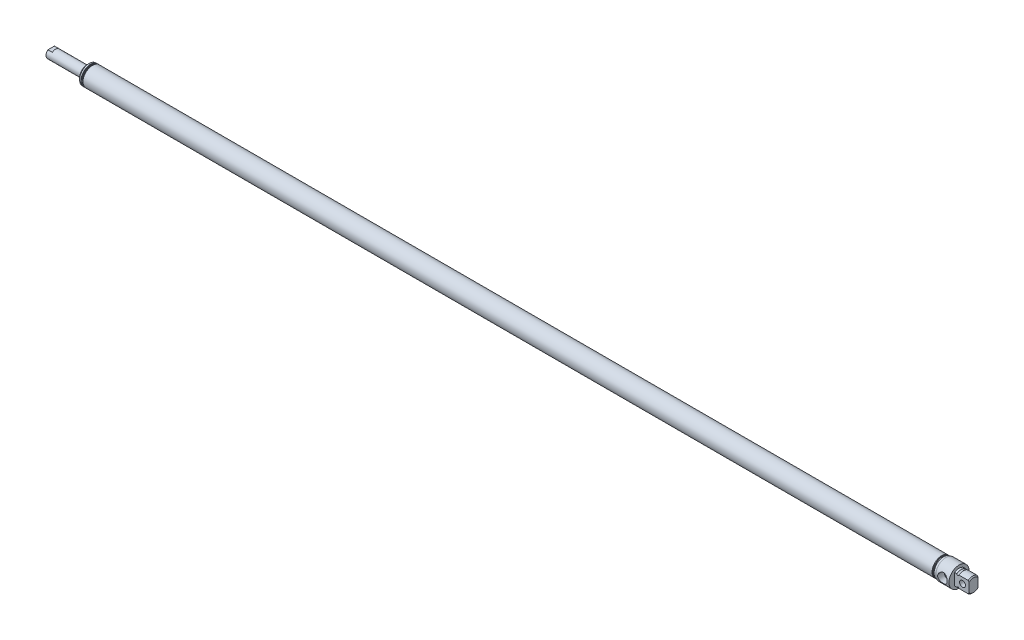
ISO-10303-21;
HEADER;
FILE_DESCRIPTION(('STEP AP214'),'2;1');
FILE_NAME('part.step','',(''),(''),'','','');
FILE_SCHEMA(('AUTOMOTIVE_DESIGN { 1 0 10303 214 1 1 1 1 }'));
ENDSEC;
DATA;
#1=APPLICATION_CONTEXT('core data for automotive mechanical design processes');
#2=APPLICATION_PROTOCOL_DEFINITION('international standard','automotive_design',2000,#1);
#3=PRODUCT_CONTEXT('',#1,'mechanical');
#4=PRODUCT('Part','Part','',(#3));
#5=PRODUCT_RELATED_PRODUCT_CATEGORY('part','',(#4));
#6=PRODUCT_DEFINITION_FORMATION('','',#4);
#7=PRODUCT_DEFINITION_CONTEXT('part definition',#1,'design');
#8=PRODUCT_DEFINITION('design','',#6,#7);
#9=PRODUCT_DEFINITION_SHAPE('','',#8);
#10=(LENGTH_UNIT() NAMED_UNIT(*) SI_UNIT(.MILLI.,.METRE.));
#11=(NAMED_UNIT(*) PLANE_ANGLE_UNIT() SI_UNIT($,.RADIAN.));
#12=(NAMED_UNIT(*) SI_UNIT($,.STERADIAN.) SOLID_ANGLE_UNIT());
#13=UNCERTAINTY_MEASURE_WITH_UNIT(LENGTH_MEASURE(1.E-05),#10,'distance_accuracy_value','');
#14=(GEOMETRIC_REPRESENTATION_CONTEXT(3) GLOBAL_UNCERTAINTY_ASSIGNED_CONTEXT((#13)) GLOBAL_UNIT_ASSIGNED_CONTEXT((#10,
#11,#12)) REPRESENTATION_CONTEXT('',''));
#15=CARTESIAN_POINT('',(0.,0.,0.));
#16=DIRECTION('',(0.,0.,1.));
#17=DIRECTION('',(1.,0.,0.));
#18=AXIS2_PLACEMENT_3D('',#15,#16,#17);
#19=CARTESIAN_POINT('',(-21.4174471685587,0.,0.));
#20=DIRECTION('',(-1.,0.,0.));
#21=DIRECTION('',(0.,0.,1.));
#22=AXIS2_PLACEMENT_3D('',#19,#20,#21);
#23=CYLINDRICAL_SURFACE('',#22,10.287);
#24=CARTESIAN_POINT('',(48.387,0.,0.));
#25=DIRECTION('',(-1.,0.,0.));
#26=DIRECTION('',(0.,0.,1.));
#27=AXIS2_PLACEMENT_3D('',#24,#25,#26);
#28=CIRCLE('',#27,10.287);
#29=CARTESIAN_POINT('',(48.387,0.,10.287));
#30=VERTEX_POINT('',#29);
#31=EDGE_CURVE('E214',#30,#30,#28,.T.);
#32=ORIENTED_EDGE('',*,*,#31,.F.);
#33=EDGE_LOOP('',(#32));
#34=FACE_BOUND('',#33,.T.);
#35=CARTESIAN_POINT('',(48.768,0.,0.));
#36=DIRECTION('',(-1.,0.,0.));
#37=DIRECTION('',(0.,0.,1.));
#38=AXIS2_PLACEMENT_3D('',#35,#36,#37);
#39=CIRCLE('',#38,10.287);
#40=CARTESIAN_POINT('',(48.768,0.,10.287));
#41=VERTEX_POINT('',#40);
#42=EDGE_CURVE('E211',#41,#41,#39,.T.);
#43=ORIENTED_EDGE('',*,*,#42,.T.);
#44=EDGE_LOOP('',(#43));
#45=FACE_BOUND('',#44,.T.);
#46=ADVANCED_FACE('F34',(#34,#45),#23,.T.);
#47=CARTESIAN_POINT('',(45.974,0.,0.));
#48=DIRECTION('',(-1.,0.,0.));
#49=DIRECTION('',(0.,0.,1.));
#50=AXIS2_PLACEMENT_3D('',#47,#48,#49);
#51=CIRCLE('',#50,10.287);
#52=CARTESIAN_POINT('',(45.974,0.,10.287));
#53=VERTEX_POINT('',#52);
#54=EDGE_CURVE('E437',#53,#53,#51,.T.);
#55=ORIENTED_EDGE('',*,*,#54,.F.);
#56=EDGE_LOOP('',(#55));
#57=FACE_BOUND('',#56,.T.);
#58=CARTESIAN_POINT('',(47.498,0.,0.));
#59=DIRECTION('',(-1.,0.,0.));
#60=DIRECTION('',(0.,0.,1.));
#61=AXIS2_PLACEMENT_3D('',#58,#59,#60);
#62=CIRCLE('',#61,10.287);
#63=CARTESIAN_POINT('',(47.498,0.,10.287));
#64=VERTEX_POINT('',#63);
#65=EDGE_CURVE('E220',#64,#64,#62,.T.);
#66=ORIENTED_EDGE('',*,*,#65,.T.);
#67=EDGE_LOOP('',(#66));
#68=FACE_BOUND('',#67,.T.);
#69=ADVANCED_FACE('F406',(#57,#68),#23,.T.);
#70=CARTESIAN_POINT('',(45.974,10.287,0.));
#71=DIRECTION('',(1.,0.,0.));
#72=DIRECTION('',(0.,0.,-1.));
#73=AXIS2_PLACEMENT_3D('',#70,#71,#72);
#74=PLANE('',#73);
#75=CARTESIAN_POINT('',(45.974,0.,0.));
#76=DIRECTION('',(-1.,0.,0.));
#77=DIRECTION('',(0.,0.,1.));
#78=AXIS2_PLACEMENT_3D('',#75,#76,#77);
#79=CIRCLE('',#78,7.9375);
#80=CARTESIAN_POINT('',(45.974,0.,7.9375));
#81=VERTEX_POINT('',#80);
#82=EDGE_CURVE('E459',#81,#81,#79,.T.);
#83=ORIENTED_EDGE('',*,*,#82,.F.);
#84=EDGE_LOOP('',(#83));
#85=FACE_BOUND('',#84,.T.);
#86=ORIENTED_EDGE('',*,*,#54,.T.);
#87=EDGE_LOOP('',(#86));
#88=FACE_BOUND('',#87,.T.);
#89=ADVANCED_FACE('F291',(#85,#88),#74,.F.);
#90=CARTESIAN_POINT('',(-21.4174471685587,0.,0.));
#91=DIRECTION('',(-1.,0.,0.));
#92=DIRECTION('',(0.,0.,1.));
#93=AXIS2_PLACEMENT_3D('',#90,#91,#92);
#94=CYLINDRICAL_SURFACE('',#93,7.9375);
#95=CARTESIAN_POINT('',(43.688,0.,0.));
#96=DIRECTION('',(-1.,0.,0.));
#97=DIRECTION('',(0.,0.,1.));
#98=AXIS2_PLACEMENT_3D('',#95,#96,#97);
#99=CIRCLE('',#98,7.9375);
#100=CARTESIAN_POINT('',(43.688,0.,7.9375));
#101=VERTEX_POINT('',#100);
#102=EDGE_CURVE('E456',#101,#101,#99,.T.);
#103=ORIENTED_EDGE('',*,*,#102,.F.);
#104=EDGE_LOOP('',(#103));
#105=FACE_BOUND('',#104,.T.);
#106=ORIENTED_EDGE('',*,*,#82,.T.);
#107=EDGE_LOOP('',(#106));
#108=FACE_BOUND('',#107,.T.);
#109=ADVANCED_FACE('F589',(#105,#108),#94,.T.);
#110=CARTESIAN_POINT('',(43.688,7.9375,0.));
#111=DIRECTION('',(1.,0.,0.));
#112=DIRECTION('',(0.,0.,-1.));
#113=AXIS2_PLACEMENT_3D('',#110,#111,#112);
#114=PLANE('',#113);
#115=CARTESIAN_POINT('',(43.688,0.,0.));
#116=DIRECTION('',(-1.,0.,0.));
#117=DIRECTION('',(0.,0.,1.));
#118=AXIS2_PLACEMENT_3D('',#115,#116,#117);
#119=CIRCLE('',#118,5.55625);
#120=CARTESIAN_POINT('',(43.688,0.,5.55625));
#121=VERTEX_POINT('',#120);
#122=EDGE_CURVE('E453',#121,#121,#119,.T.);
#123=ORIENTED_EDGE('',*,*,#122,.F.);
#124=EDGE_LOOP('',(#123));
#125=FACE_BOUND('',#124,.T.);
#126=ORIENTED_EDGE('',*,*,#102,.T.);
#127=EDGE_LOOP('',(#126));
#128=FACE_BOUND('',#127,.T.);
#129=ADVANCED_FACE('F586',(#125,#128),#114,.F.);
#130=CARTESIAN_POINT('',(-21.4174471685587,0.,0.));
#131=DIRECTION('',(-1.,0.,0.));
#132=DIRECTION('',(0.,0.,1.));
#133=AXIS2_PLACEMENT_3D('',#130,#131,#132);
#134=CYLINDRICAL_SURFACE('',#133,5.55625);
#135=CARTESIAN_POINT('',(9.652,0.,0.));
#136=DIRECTION('',(-1.,0.,0.));
#137=DIRECTION('',(0.,0.,1.));
#138=AXIS2_PLACEMENT_3D('',#135,#136,#137);
#139=CIRCLE('',#138,5.55625);
#140=CARTESIAN_POINT('',(9.652,4.318,3.4966827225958));
#141=VERTEX_POINT('',#140);
#142=CARTESIAN_POINT('',(9.652,4.318,-3.4966827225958));
#143=VERTEX_POINT('',#142);
#144=EDGE_CURVE('E158',#141,#143,#139,.T.);
#145=ORIENTED_EDGE('',*,*,#144,.F.);
#146=DIRECTION('',(-1.,0.,0.));
#147=VECTOR('',#146,1.);
#148=CARTESIAN_POINT('',(9.652,4.318,3.4966827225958));
#149=LINE('',#148,#147);
#150=CARTESIAN_POINT('',(4.826,4.318,3.4966827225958));
#151=VERTEX_POINT('',#150);
#152=EDGE_CURVE('E170',#141,#151,#149,.T.);
#153=ORIENTED_EDGE('',*,*,#152,.T.);
#154=CARTESIAN_POINT('',(4.826,0.,0.));
#155=DIRECTION('',(-1.,0.,0.));
#156=DIRECTION('',(0.,0.,1.));
#157=AXIS2_PLACEMENT_3D('',#154,#155,#156);
#158=CIRCLE('',#157,5.55625);
#159=CARTESIAN_POINT('',(4.826,-4.318,3.4966827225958));
#160=VERTEX_POINT('',#159);
#161=EDGE_CURVE('E450',#160,#151,#158,.T.);
#162=ORIENTED_EDGE('',*,*,#161,.F.);
#163=DIRECTION('',(-1.,0.,0.));
#164=VECTOR('',#163,1.);
#165=CARTESIAN_POINT('',(9.652,-4.318,3.4966827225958));
#166=LINE('',#165,#164);
#167=CARTESIAN_POINT('',(9.652,-4.318,3.4966827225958));
#168=VERTEX_POINT('',#167);
#169=EDGE_CURVE('E180',#168,#160,#166,.T.);
#170=ORIENTED_EDGE('',*,*,#169,.F.);
#171=CARTESIAN_POINT('',(9.652,0.,0.));
#172=DIRECTION('',(-1.,0.,0.));
#173=DIRECTION('',(0.,0.,1.));
#174=AXIS2_PLACEMENT_3D('',#171,#172,#173);
#175=CIRCLE('',#174,5.55625);
#176=CARTESIAN_POINT('',(9.652,-4.318,-3.4966827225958));
#177=VERTEX_POINT('',#176);
#178=EDGE_CURVE('E175',#177,#168,#175,.T.);
#179=ORIENTED_EDGE('',*,*,#178,.F.);
#180=DIRECTION('',(-1.,0.,0.));
#181=VECTOR('',#180,1.);
#182=CARTESIAN_POINT('',(9.652,-4.318,-3.4966827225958));
#183=LINE('',#182,#181);
#184=CARTESIAN_POINT('',(4.826,-4.318,-3.4966827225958));
#185=VERTEX_POINT('',#184);
#186=EDGE_CURVE('E183',#177,#185,#183,.T.);
#187=ORIENTED_EDGE('',*,*,#186,.T.);
#188=CARTESIAN_POINT('',(4.826,4.318,-3.4966827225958));
#189=VERTEX_POINT('',#188);
#190=EDGE_CURVE('E449',#189,#185,#158,.T.);
#191=ORIENTED_EDGE('',*,*,#190,.F.);
#192=DIRECTION('',(-1.,0.,0.));
#193=VECTOR('',#192,1.);
#194=CARTESIAN_POINT('',(9.652,4.318,-3.4966827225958));
#195=LINE('',#194,#193);
#196=EDGE_CURVE('E168',#143,#189,#195,.T.);
#197=ORIENTED_EDGE('',*,*,#196,.F.);
#198=EDGE_LOOP('',(#145,#153,#162,#170,#179,#187,#191,#197));
#199=FACE_BOUND('',#198,.T.);
#200=ORIENTED_EDGE('',*,*,#122,.T.);
#201=EDGE_LOOP('',(#200));
#202=FACE_BOUND('',#201,.T.);
#203=ADVANCED_FACE('F583',(#199,#202),#134,.T.);
#204=CARTESIAN_POINT('',(4.826,5.55625,0.));
#205=DIRECTION('',(1.,0.,0.));
#206=DIRECTION('',(0.,0.,-1.));
#207=AXIS2_PLACEMENT_3D('',#204,#205,#206);
#208=PLANE('',#207);
#209=CARTESIAN_POINT('',(4.826,0.,0.));
#210=DIRECTION('',(1.,0.,0.));
#211=DIRECTION('',(0.,0.,-1.));
#212=AXIS2_PLACEMENT_3D('',#209,#210,#211);
#213=CIRCLE('',#212,3.175);
#214=CARTESIAN_POINT('',(4.826,0.,-3.175));
#215=VERTEX_POINT('',#214);
#216=EDGE_CURVE('E443',#215,#215,#213,.T.);
#217=ORIENTED_EDGE('',*,*,#216,.T.);
#218=EDGE_LOOP('',(#217));
#219=FACE_BOUND('',#218,.T.);
#220=ORIENTED_EDGE('',*,*,#161,.T.);
#221=DIRECTION('',(0.,0.,1.));
#222=VECTOR('',#221,1.);
#223=CARTESIAN_POINT('',(4.826,4.318,-3.4966827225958));
#224=LINE('',#223,#222);
#225=EDGE_CURVE('E155',#189,#151,#224,.T.);
#226=ORIENTED_EDGE('',*,*,#225,.F.);
#227=ORIENTED_EDGE('',*,*,#190,.T.);
#228=DIRECTION('',(0.,0.,-1.));
#229=VECTOR('',#228,1.);
#230=CARTESIAN_POINT('',(4.826,-4.318,-3.4966827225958));
#231=LINE('',#230,#229);
#232=EDGE_CURVE('E173',#160,#185,#231,.T.);
#233=ORIENTED_EDGE('',*,*,#232,.F.);
#234=EDGE_LOOP('',(#220,#226,#227,#233));
#235=FACE_BOUND('',#234,.T.);
#236=ADVANCED_FACE('F509',(#219,#235),#208,.F.);
#237=CARTESIAN_POINT('',(0.,0.,0.));
#238=DIRECTION('',(1.,0.,0.));
#239=DIRECTION('',(0.,0.,-1.));
#240=AXIS2_PLACEMENT_3D('',#237,#238,#239);
#241=CYLINDRICAL_SURFACE('',#240,3.17500000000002);
#242=ORIENTED_EDGE('',*,*,#216,.F.);
#243=EDGE_LOOP('',(#242));
#244=FACE_BOUND('',#243,.T.);
#245=CARTESIAN_POINT('',(244.4115,0.,0.));
#246=DIRECTION('',(1.,0.,0.));
#247=DIRECTION('',(0.,0.,-1.));
#248=AXIS2_PLACEMENT_3D('',#245,#246,#247);
#249=CIRCLE('',#248,3.17500000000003);
#250=CARTESIAN_POINT('',(244.4115,0.,-3.17500000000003));
#251=VERTEX_POINT('',#250);
#252=EDGE_CURVE('E504',#251,#251,#249,.T.);
#253=ORIENTED_EDGE('',*,*,#252,.T.);
#254=EDGE_LOOP('',(#253));
#255=FACE_BOUND('',#254,.T.);
#256=ADVANCED_FACE('F512',(#244,#255),#241,.F.);
#257=CARTESIAN_POINT('',(244.4115,9.52500000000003,0.));
#258=DIRECTION('',(-1.,0.,0.));
#259=DIRECTION('',(0.,0.,1.));
#260=AXIS2_PLACEMENT_3D('',#257,#258,#259);
#261=PLANE('',#260);
#262=ORIENTED_EDGE('',*,*,#252,.F.);
#263=EDGE_LOOP('',(#262));
#264=FACE_BOUND('',#263,.T.);
#265=CARTESIAN_POINT('',(244.4115,0.,0.));
#266=DIRECTION('',(1.,0.,0.));
#267=DIRECTION('',(0.,0.,-1.));
#268=AXIS2_PLACEMENT_3D('',#265,#266,#267);
#269=CIRCLE('',#268,9.52500000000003);
#270=CARTESIAN_POINT('',(244.4115,0.,-9.52500000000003));
#271=VERTEX_POINT('',#270);
#272=EDGE_CURVE('E501',#271,#271,#269,.T.);
#273=ORIENTED_EDGE('',*,*,#272,.T.);
#274=EDGE_LOOP('',(#273));
#275=FACE_BOUND('',#274,.T.);
#276=ADVANCED_FACE('F515',(#264,#275),#261,.F.);
#277=CARTESIAN_POINT('',(0.,0.,0.));
#278=DIRECTION('',(1.,0.,0.));
#279=DIRECTION('',(0.,0.,-1.));
#280=AXIS2_PLACEMENT_3D('',#277,#278,#279);
#281=CYLINDRICAL_SURFACE('',#280,9.52500000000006);
#282=ORIENTED_EDGE('',*,*,#272,.F.);
#283=EDGE_LOOP('',(#282));
#284=FACE_BOUND('',#283,.T.);
#285=CARTESIAN_POINT('',(790.5115,0.,0.));
#286=DIRECTION('',(1.,0.,0.));
#287=DIRECTION('',(0.,0.,-1.));
#288=AXIS2_PLACEMENT_3D('',#285,#286,#287);
#289=CIRCLE('',#288,9.5250000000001);
#290=CARTESIAN_POINT('',(790.5115,0.,-9.5250000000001));
#291=VERTEX_POINT('',#290);
#292=EDGE_CURVE('E498',#291,#291,#289,.T.);
#293=ORIENTED_EDGE('',*,*,#292,.T.);
#294=EDGE_LOOP('',(#293));
#295=FACE_BOUND('',#294,.T.);
#296=ADVANCED_FACE('F401',(#284,#295),#281,.F.);
#297=CARTESIAN_POINT('',(790.5115,0.,0.));
#298=DIRECTION('',(1.,0.,0.));
#299=DIRECTION('',(0.,0.,-1.));
#300=AXIS2_PLACEMENT_3D('',#297,#298,#299);
#301=PLANE('',#300);
#302=ORIENTED_EDGE('',*,*,#292,.F.);
#303=EDGE_LOOP('',(#302));
#304=FACE_BOUND('',#303,.T.);
#305=ADVANCED_FACE('F396',(#304),#301,.F.);
#306=CARTESIAN_POINT('',(47.498,10.287,0.));
#307=DIRECTION('',(1.,0.,0.));
#308=DIRECTION('',(0.,0.,-1.));
#309=AXIS2_PLACEMENT_3D('',#306,#307,#308);
#310=PLANE('',#309);
#311=CARTESIAN_POINT('',(47.498,0.,0.));
#312=DIRECTION('',(-1.,0.,0.));
#313=DIRECTION('',(0.,0.,1.));
#314=AXIS2_PLACEMENT_3D('',#311,#312,#313);
#315=CIRCLE('',#314,9.398);
#316=CARTESIAN_POINT('',(47.498,0.,9.398));
#317=VERTEX_POINT('',#316);
#318=EDGE_CURVE('E217',#317,#317,#315,.T.);
#319=ORIENTED_EDGE('',*,*,#318,.T.);
#320=EDGE_LOOP('',(#319));
#321=FACE_BOUND('',#320,.T.);
#322=ORIENTED_EDGE('',*,*,#65,.F.);
#323=EDGE_LOOP('',(#322));
#324=FACE_BOUND('',#323,.T.);
#325=ADVANCED_FACE('F393',(#321,#324),#310,.T.);
#326=CARTESIAN_POINT('',(47.498,0.,0.));
#327=DIRECTION('',(1.,0.,0.));
#328=DIRECTION('',(0.,0.,-1.));
#329=AXIS2_PLACEMENT_3D('',#326,#327,#328);
#330=CONICAL_SURFACE('',#329,9.398,0.785398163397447);
#331=ORIENTED_EDGE('',*,*,#31,.T.);
#332=EDGE_LOOP('',(#331));
#333=FACE_BOUND('',#332,.T.);
#334=ORIENTED_EDGE('',*,*,#318,.F.);
#335=EDGE_LOOP('',(#334));
#336=FACE_BOUND('',#335,.T.);
#337=ADVANCED_FACE('F390',(#333,#336),#330,.T.);
#338=CARTESIAN_POINT('',(48.768,10.287,0.));
#339=DIRECTION('',(1.,0.,0.));
#340=DIRECTION('',(0.,0.,-1.));
#341=AXIS2_PLACEMENT_3D('',#338,#339,#340);
#342=PLANE('',#341);
#343=CARTESIAN_POINT('',(48.768,0.,0.));
#344=DIRECTION('',(-1.,0.,0.));
#345=DIRECTION('',(0.,0.,1.));
#346=AXIS2_PLACEMENT_3D('',#343,#344,#345);
#347=CIRCLE('',#346,9.398);
#348=CARTESIAN_POINT('',(48.768,0.,9.398));
#349=VERTEX_POINT('',#348);
#350=EDGE_CURVE('E208',#349,#349,#347,.T.);
#351=ORIENTED_EDGE('',*,*,#350,.T.);
#352=EDGE_LOOP('',(#351));
#353=FACE_BOUND('',#352,.T.);
#354=ORIENTED_EDGE('',*,*,#42,.F.);
#355=EDGE_LOOP('',(#354));
#356=FACE_BOUND('',#355,.T.);
#357=ADVANCED_FACE('F386',(#353,#356),#342,.T.);
#358=CARTESIAN_POINT('',(48.768,0.,0.));
#359=DIRECTION('',(1.,0.,0.));
#360=DIRECTION('',(0.,0.,-1.));
#361=AXIS2_PLACEMENT_3D('',#358,#359,#360);
#362=CONICAL_SURFACE('',#361,9.398,0.785398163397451);
#363=CARTESIAN_POINT('',(49.657,0.,0.));
#364=DIRECTION('',(-1.,0.,0.));
#365=DIRECTION('',(0.,0.,1.));
#366=AXIS2_PLACEMENT_3D('',#363,#364,#365);
#367=CIRCLE('',#366,10.287);
#368=CARTESIAN_POINT('',(49.657,0.,10.287));
#369=VERTEX_POINT('',#368);
#370=EDGE_CURVE('E205',#369,#369,#367,.T.);
#371=ORIENTED_EDGE('',*,*,#370,.T.);
#372=EDGE_LOOP('',(#371));
#373=FACE_BOUND('',#372,.T.);
#374=ORIENTED_EDGE('',*,*,#350,.F.);
#375=EDGE_LOOP('',(#374));
#376=FACE_BOUND('',#375,.T.);
#377=ADVANCED_FACE('F383',(#373,#376),#362,.T.);
#378=CARTESIAN_POINT('',(970.026,0.,0.));
#379=DIRECTION('',(1.,0.,0.));
#380=DIRECTION('',(0.,0.,-1.));
#381=AXIS2_PLACEMENT_3D('',#378,#379,#380);
#382=CIRCLE('',#381,10.287);
#383=CARTESIAN_POINT('',(970.026,0.,-10.287));
#384=VERTEX_POINT('',#383);
#385=EDGE_CURVE('E196',#384,#384,#382,.T.);
#386=ORIENTED_EDGE('',*,*,#385,.F.);
#387=EDGE_LOOP('',(#386));
#388=FACE_BOUND('',#387,.T.);
#389=ORIENTED_EDGE('',*,*,#370,.F.);
#390=EDGE_LOOP('',(#389));
#391=FACE_BOUND('',#390,.T.);
#392=ADVANCED_FACE('F381',(#388,#391),#23,.T.);
#393=CARTESIAN_POINT('',(970.915,9.39799999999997,0.));
#394=DIRECTION('',(1.,0.,0.));
#395=DIRECTION('',(0.,0.,-1.));
#396=AXIS2_PLACEMENT_3D('',#393,#394,#395);
#397=PLANE('',#396);
#398=CARTESIAN_POINT('',(970.915,0.,0.));
#399=DIRECTION('',(1.,0.,0.));
#400=DIRECTION('',(0.,0.,-1.));
#401=AXIS2_PLACEMENT_3D('',#398,#399,#400);
#402=CIRCLE('',#401,10.287);
#403=CARTESIAN_POINT('',(970.915,0.,-10.287));
#404=VERTEX_POINT('',#403);
#405=EDGE_CURVE('E202',#404,#404,#402,.T.);
#406=ORIENTED_EDGE('',*,*,#405,.F.);
#407=EDGE_LOOP('',(#406));
#408=FACE_BOUND('',#407,.T.);
#409=CARTESIAN_POINT('',(970.915,0.,0.));
#410=DIRECTION('',(1.,0.,0.));
#411=DIRECTION('',(0.,0.,-1.));
#412=AXIS2_PLACEMENT_3D('',#409,#410,#411);
#413=CIRCLE('',#412,9.39799999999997);
#414=CARTESIAN_POINT('',(970.915,0.,-9.39799999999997));
#415=VERTEX_POINT('',#414);
#416=EDGE_CURVE('E199',#415,#415,#413,.T.);
#417=ORIENTED_EDGE('',*,*,#416,.T.);
#418=EDGE_LOOP('',(#417));
#419=FACE_BOUND('',#418,.T.);
#420=ADVANCED_FACE('F377',(#408,#419),#397,.F.);
#421=CARTESIAN_POINT('',(970.026,0.,0.));
#422=DIRECTION('',(-1.,0.,0.));
#423=DIRECTION('',(0.,0.,1.));
#424=AXIS2_PLACEMENT_3D('',#421,#422,#423);
#425=CONICAL_SURFACE('',#424,10.287,0.785398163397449);
#426=ORIENTED_EDGE('',*,*,#416,.F.);
#427=EDGE_LOOP('',(#426));
#428=FACE_BOUND('',#427,.T.);
#429=ORIENTED_EDGE('',*,*,#385,.T.);
#430=EDGE_LOOP('',(#429));
#431=FACE_BOUND('',#430,.T.);
#432=ADVANCED_FACE('F374',(#428,#431),#425,.T.);
#433=CARTESIAN_POINT('',(971.296,0.,0.));
#434=DIRECTION('',(1.,0.,0.));
#435=DIRECTION('',(0.,0.,-1.));
#436=AXIS2_PLACEMENT_3D('',#433,#434,#435);
#437=CIRCLE('',#436,10.287);
#438=CARTESIAN_POINT('',(971.296,0.,-10.287));
#439=VERTEX_POINT('',#438);
#440=EDGE_CURVE('E186',#439,#439,#437,.T.);
#441=ORIENTED_EDGE('',*,*,#440,.F.);
#442=EDGE_LOOP('',(#441));
#443=FACE_BOUND('',#442,.T.);
#444=ORIENTED_EDGE('',*,*,#405,.T.);
#445=EDGE_LOOP('',(#444));
#446=FACE_BOUND('',#445,.T.);
#447=ADVANCED_FACE('F372',(#443,#446),#23,.T.);
#448=CARTESIAN_POINT('',(972.185,9.39799999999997,0.));
#449=DIRECTION('',(1.,0.,0.));
#450=DIRECTION('',(0.,0.,-1.));
#451=AXIS2_PLACEMENT_3D('',#448,#449,#450);
#452=PLANE('',#451);
#453=CARTESIAN_POINT('',(972.185,0.,0.));
#454=DIRECTION('',(1.,0.,0.));
#455=DIRECTION('',(0.,0.,-1.));
#456=AXIS2_PLACEMENT_3D('',#453,#454,#455);
#457=CIRCLE('',#456,10.287);
#458=CARTESIAN_POINT('',(972.185,0.,-10.287));
#459=VERTEX_POINT('',#458);
#460=EDGE_CURVE('E193',#459,#459,#457,.T.);
#461=ORIENTED_EDGE('',*,*,#460,.F.);
#462=EDGE_LOOP('',(#461));
#463=FACE_BOUND('',#462,.T.);
#464=CARTESIAN_POINT('',(972.185,0.,0.));
#465=DIRECTION('',(1.,0.,0.));
#466=DIRECTION('',(0.,0.,-1.));
#467=AXIS2_PLACEMENT_3D('',#464,#465,#466);
#468=CIRCLE('',#467,9.39799999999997);
#469=CARTESIAN_POINT('',(972.185,0.,-9.39799999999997));
#470=VERTEX_POINT('',#469);
#471=EDGE_CURVE('E190',#470,#470,#468,.T.);
#472=ORIENTED_EDGE('',*,*,#471,.T.);
#473=EDGE_LOOP('',(#472));
#474=FACE_BOUND('',#473,.T.);
#475=ADVANCED_FACE('F368',(#463,#474),#452,.F.);
#476=CARTESIAN_POINT('',(971.296,0.,0.));
#477=DIRECTION('',(-1.,0.,0.));
#478=DIRECTION('',(0.,0.,1.));
#479=AXIS2_PLACEMENT_3D('',#476,#477,#478);
#480=CONICAL_SURFACE('',#479,10.287,0.785398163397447);
#481=ORIENTED_EDGE('',*,*,#471,.F.);
#482=EDGE_LOOP('',(#481));
#483=FACE_BOUND('',#482,.T.);
#484=ORIENTED_EDGE('',*,*,#440,.T.);
#485=EDGE_LOOP('',(#484));
#486=FACE_BOUND('',#485,.T.);
#487=ADVANCED_FACE('F365',(#483,#486),#480,.T.);
#488=CARTESIAN_POINT('',(992.505,0.,0.));
#489=DIRECTION('',(-1.,0.,0.));
#490=DIRECTION('',(0.,0.,1.));
#491=AXIS2_PLACEMENT_3D('',#488,#489,#490);
#492=TOROIDAL_SURFACE('',#491,8.49108016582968,1.27);
#493=CARTESIAN_POINT('',(993.648,0.,0.));
#494=DIRECTION('',(-1.,0.,0.));
#495=DIRECTION('',(0.,0.,1.));
#496=AXIS2_PLACEMENT_3D('',#493,#494,#495);
#497=CIRCLE('',#496,7.93750000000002);
#498=CARTESIAN_POINT('',(993.648,6.30187513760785,4.826));
#499=VERTEX_POINT('',#498);
#500=CARTESIAN_POINT('',(993.648,6.30187513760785,-4.826));
#501=VERTEX_POINT('',#500);
#502=EDGE_CURVE('E492',#499,#501,#497,.T.);
#503=ORIENTED_EDGE('',*,*,#502,.T.);
#504=CARTESIAN_POINT('',(992.111655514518,5.45522840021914,-4.826));
#505=CARTESIAN_POINT('',(992.044420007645,5.48447214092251,-4.826));
#506=CARTESIAN_POINT('',(991.980186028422,5.52063367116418,-4.826));
#507=CARTESIAN_POINT('',(991.859174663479,5.60380381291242,-4.826));
#508=CARTESIAN_POINT('',(991.80241261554,5.65083420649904,-4.826));
#509=CARTESIAN_POINT('',(991.697443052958,5.75257635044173,-4.826));
#510=CARTESIAN_POINT('',(991.649156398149,5.80720743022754,-4.826));
#511=CARTESIAN_POINT('',(991.560555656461,5.92249021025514,-4.826));
#512=CARTESIAN_POINT('',(991.520238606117,5.98313965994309,-4.826));
#513=CARTESIAN_POINT('',(991.439833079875,6.1222639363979,-4.826));
#514=CARTESIAN_POINT('',(991.401582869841,6.20180195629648,-4.826));
#515=CARTESIAN_POINT('',(991.33665523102,6.36549199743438,-4.826));
#516=CARTESIAN_POINT('',(991.309988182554,6.44964808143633,-4.826));
#517=CARTESIAN_POINT('',(991.264723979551,6.63603683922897,-4.826));
#518=CARTESIAN_POINT('',(991.248396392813,6.73882869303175,-4.826));
#519=CARTESIAN_POINT('',(991.232602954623,6.94578115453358,-4.826));
#520=CARTESIAN_POINT('',(991.233149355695,7.04994270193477,-4.826));
#521=CARTESIAN_POINT('',(991.252178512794,7.25998338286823,-4.826));
#522=CARTESIAN_POINT('',(991.271224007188,7.36581372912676,-4.826));
#523=CARTESIAN_POINT('',(991.328920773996,7.57196677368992,-4.826));
#524=CARTESIAN_POINT('',(991.367538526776,7.67229856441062,-4.826));
#525=CARTESIAN_POINT('',(991.451779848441,7.83754802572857,-4.826));
#526=CARTESIAN_POINT('',(991.492837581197,7.90480634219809,-4.826));
#527=CARTESIAN_POINT('',(991.585500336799,8.03166878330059,-4.826));
#528=CARTESIAN_POINT('',(991.637100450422,8.09127644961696,-4.826));
#529=CARTESIAN_POINT('',(991.750520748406,8.2007569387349,-4.826));
#530=CARTESIAN_POINT('',(991.812407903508,8.25056096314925,-4.826));
#531=CARTESIAN_POINT('',(991.944650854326,8.33730816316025,-4.826));
#532=CARTESIAN_POINT('',(992.015000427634,8.37426071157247,-4.826));
#533=CARTESIAN_POINT('',(992.152708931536,8.42941397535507,-4.826));
#534=CARTESIAN_POINT('',(992.219368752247,8.4493638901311,-4.826));
#535=CARTESIAN_POINT('',(992.355222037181,8.47656559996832,-4.826));
#536=CARTESIAN_POINT('',(992.424413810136,8.48382571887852,-4.826));
#537=CARTESIAN_POINT('',(992.556765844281,8.48519123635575,-4.826));
#538=CARTESIAN_POINT('',(992.619917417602,8.48040501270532,-4.826));
#539=CARTESIAN_POINT('',(992.744484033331,8.46020188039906,-4.826));
#540=CARTESIAN_POINT('',(992.805899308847,8.44478640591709,-4.826));
#541=CARTESIAN_POINT('',(992.924881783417,8.40418192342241,-4.826));
#542=CARTESIAN_POINT('',(992.982473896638,8.37906540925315,-4.826));
#543=CARTESIAN_POINT('',(993.092976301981,8.32009082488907,-4.826));
#544=CARTESIAN_POINT('',(993.14588564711,8.28623099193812,-4.826));
#545=CARTESIAN_POINT('',(993.249303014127,8.2085372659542,-4.826));
#546=CARTESIAN_POINT('',(993.299429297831,8.16419685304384,-4.826));
#547=CARTESIAN_POINT('',(993.392483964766,8.06853735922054,-4.826));
#548=CARTESIAN_POINT('',(993.435409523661,8.01721555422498,-4.826));
#549=CARTESIAN_POINT('',(993.518284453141,7.90267855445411,-4.826));
#550=CARTESIAN_POINT('',(993.557280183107,7.83877463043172,-4.826));
#551=CARTESIAN_POINT('',(993.62557536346,7.70599654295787,-4.826));
#552=CARTESIAN_POINT('',(993.654869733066,7.63711979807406,-4.826));
#553=CARTESIAN_POINT('',(993.70747575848,7.485568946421,-4.826));
#554=CARTESIAN_POINT('',(993.729255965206,7.40236346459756,-4.826));
#555=CARTESIAN_POINT('',(993.760491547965,7.23368861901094,-4.826));
#556=CARTESIAN_POINT('',(993.769941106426,7.14821820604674,-4.826));
#557=CARTESIAN_POINT('',(993.777460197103,6.96429657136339,-4.826));
#558=CARTESIAN_POINT('',(993.773672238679,6.865767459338,-4.826));
#559=CARTESIAN_POINT('',(993.751081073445,6.67037257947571,-4.826));
#560=CARTESIAN_POINT('',(993.732261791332,6.57350870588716,-4.826));
#561=CARTESIAN_POINT('',(993.677631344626,6.37514774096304,-4.826));
#562=CARTESIAN_POINT('',(993.640431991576,6.27402902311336,-4.826));
#563=CARTESIAN_POINT('',(993.548823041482,6.07988493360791,-4.826));
#564=CARTESIAN_POINT('',(993.494432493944,5.98685074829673,-4.826));
#565=CARTESIAN_POINT('',(993.386560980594,5.83822087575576,-4.826));
#566=CARTESIAN_POINT('',(993.337306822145,5.77954756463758,-4.826));
#567=CARTESIAN_POINT('',(993.230116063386,5.67075199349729,-4.826));
#568=CARTESIAN_POINT('',(993.172193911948,5.62061579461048,-4.826));
#569=CARTESIAN_POINT('',(993.060583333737,5.54061144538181,-4.826));
#570=CARTESIAN_POINT('',(993.008368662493,5.50869509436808,-4.826));
#571=CARTESIAN_POINT('',(992.899384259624,5.45384086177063,-4.826));
#572=CARTESIAN_POINT('',(992.842617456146,5.43089726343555,-4.826));
#573=CARTESIAN_POINT('',(992.725383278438,5.39550650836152,-4.826));
#574=CARTESIAN_POINT('',(992.664891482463,5.38313883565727,-4.826));
#575=CARTESIAN_POINT('',(992.542666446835,5.37033512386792,-4.826));
#576=CARTESIAN_POINT('',(992.480934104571,5.36989075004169,-4.826));
#577=CARTESIAN_POINT('',(992.366708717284,5.38020642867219,-4.826));
#578=CARTESIAN_POINT('',(992.31407510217,5.38948993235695,-4.826));
#579=CARTESIAN_POINT('',(992.210983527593,5.41637081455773,-4.826));
#580=CARTESIAN_POINT('',(992.160526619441,5.43397216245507,-4.826));
#581=CARTESIAN_POINT('',(992.111655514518,5.45522840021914,-4.826));
#582=B_SPLINE_CURVE_WITH_KNOTS('',3,(#504,#505,#506,#507,#508,#509,#510,#511,#512,#513,#514,
#515,#516,#517,#518,#519,#520,#521,#522,#523,#524,#525,#526,#527,#528,#529,#530,#531,#532,#533,
#534,#535,#536,#537,#538,#539,#540,#541,#542,#543,#544,#545,#546,#547,#548,#549,#550,#551,#552,
#553,#554,#555,#556,#557,#558,#559,#560,#561,#562,#563,#564,#565,#566,#567,#568,#569,#570,#571,
#572,#573,#574,#575,#576,#577,#578,#579,#580,#581),.UNSPECIFIED.,.T.,.F.,(4,2,2,2,2,2,2,2,2,2,2,
2,2,2,2,2,2,2,2,2,2,2,2,2,2,2,2,2,2,2,2,2,2,2,2,2,2,2,4),(0.,0.219701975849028,
0.439848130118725,0.657814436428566,0.875699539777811,1.1394962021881,1.40352878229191,
1.71438170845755,2.02546035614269,2.34630818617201,2.66660837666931,2.90205976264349,
3.13740175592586,3.3743406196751,3.61110631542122,3.81870620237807,4.02616986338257,
4.2152546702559,4.40431396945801,4.59198698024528,4.77969785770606,4.97965257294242,
5.17968553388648,5.40339486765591,5.62722117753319,5.88424008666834,6.14138021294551,
6.43596420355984,6.73086366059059,7.05255049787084,7.37388211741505,7.60290930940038,
7.83155889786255,8.01443494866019,8.19719429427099,8.38131540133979,8.56530779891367,
8.72492512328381,8.88461869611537),.UNSPECIFIED.);
#583=CARTESIAN_POINT('',(991.362,6.30187513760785,-4.826));
#584=VERTEX_POINT('',#583);
#585=EDGE_CURVE('E240',#501,#584,#582,.T.);
#586=ORIENTED_EDGE('',*,*,#585,.T.);
#587=CARTESIAN_POINT('',(991.362,0.,0.));
#588=DIRECTION('',(-1.,0.,0.));
#589=DIRECTION('',(0.,0.,1.));
#590=AXIS2_PLACEMENT_3D('',#587,#588,#589);
#591=CIRCLE('',#590,7.93750000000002);
#592=CARTESIAN_POINT('',(991.362,6.30187513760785,4.826));
#593=VERTEX_POINT('',#592);
#594=EDGE_CURVE('E496',#593,#584,#591,.T.);
#595=ORIENTED_EDGE('',*,*,#594,.F.);
#596=CARTESIAN_POINT('',(992.111655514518,5.45522840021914,4.826));
#597=CARTESIAN_POINT('',(992.162111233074,5.43328339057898,4.826));
#598=CARTESIAN_POINT('',(992.214261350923,5.4152310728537,4.826));
#599=CARTESIAN_POINT('',(992.320841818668,5.38803813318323,4.826));
#600=CARTESIAN_POINT('',(992.375270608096,5.37889151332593,4.826));
#601=CARTESIAN_POINT('',(992.485040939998,5.37017462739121,4.826));
#602=CARTESIAN_POINT('',(992.540384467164,5.37062900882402,4.826));
#603=CARTESIAN_POINT('',(992.650149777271,5.38113759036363,4.826));
#604=CARTESIAN_POINT('',(992.70457136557,5.39119379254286,4.826));
#605=CARTESIAN_POINT('',(992.80957968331,5.41977879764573,4.826));
#606=CARTESIAN_POINT('',(992.86022940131,5.43807987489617,4.826));
#607=CARTESIAN_POINT('',(992.958232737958,5.48198974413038,4.826));
#608=CARTESIAN_POINT('',(993.005584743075,5.50760208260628,4.826));
#609=CARTESIAN_POINT('',(993.114252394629,5.57624827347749,4.826));
#610=CARTESIAN_POINT('',(993.173744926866,5.62217328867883,4.826));
#611=CARTESIAN_POINT('',(993.284504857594,5.72307524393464,4.826));
#612=CARTESIAN_POINT('',(993.335754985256,5.77807071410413,4.826));
#613=CARTESIAN_POINT('',(993.443016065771,5.91118580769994,4.826));
#614=CARTESIAN_POINT('',(993.496340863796,5.99146817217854,4.826));
#615=CARTESIAN_POINT('',(993.589203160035,6.15957020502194,4.826));
#616=CARTESIAN_POINT('',(993.628733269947,6.24739388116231,4.826));
#617=CARTESIAN_POINT('',(993.694402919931,6.42917384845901,4.826));
#618=CARTESIAN_POINT('',(993.720363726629,6.52319447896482,4.826));
#619=CARTESIAN_POINT('',(993.757838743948,6.71408764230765,4.826));
#620=CARTESIAN_POINT('',(993.769348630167,6.81096101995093,4.826));
#621=CARTESIAN_POINT('',(993.777841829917,7.01582940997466,4.826));
#622=CARTESIAN_POINT('',(993.773131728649,7.12390119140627,4.826));
#623=CARTESIAN_POINT('',(993.744468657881,7.33747556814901,4.826));
#624=CARTESIAN_POINT('',(993.720532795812,7.44298036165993,4.826));
#625=CARTESIAN_POINT('',(993.660005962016,7.62538430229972,4.826));
#626=CARTESIAN_POINT('',(993.627241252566,7.70355745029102,4.826));
#627=CARTESIAN_POINT('',(993.549267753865,7.85348574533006,4.826));
#628=CARTESIAN_POINT('',(993.504063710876,7.92524332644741,4.826));
#629=CARTESIAN_POINT('',(993.401114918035,8.06007558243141,4.826));
#630=CARTESIAN_POINT('',(993.34327830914,8.12308081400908,4.826));
#631=CARTESIAN_POINT('',(993.216337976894,8.2365424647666,4.826));
#632=CARTESIAN_POINT('',(993.147244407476,8.28701009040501,4.826));
#633=CARTESIAN_POINT('',(993.010121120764,8.36636861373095,4.826));
#634=CARTESIAN_POINT('',(992.943257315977,8.39727467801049,4.826));
#635=CARTESIAN_POINT('',(992.804854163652,8.44570527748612,4.826));
#636=CARTESIAN_POINT('',(992.733319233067,8.46324226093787,4.826));
#637=CARTESIAN_POINT('',(992.596743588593,8.48267492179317,4.826));
#638=CARTESIAN_POINT('',(992.531925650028,8.48616433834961,4.826));
#639=CARTESIAN_POINT('',(992.402689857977,8.48174520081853,4.826));
#640=CARTESIAN_POINT('',(992.338271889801,8.47384008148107,4.826));
#641=CARTESIAN_POINT('',(992.214165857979,8.44753682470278,4.826));
#642=CARTESIAN_POINT('',(992.154391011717,8.42954340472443,4.826));
#643=CARTESIAN_POINT('',(992.038537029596,8.38416014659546,4.826));
#644=CARTESIAN_POINT('',(991.982458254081,8.35676939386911,4.826));
#645=CARTESIAN_POINT('',(991.873023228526,8.29237576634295,4.826));
#646=CARTESIAN_POINT('',(991.819872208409,8.25502550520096,4.826));
#647=CARTESIAN_POINT('',(991.719869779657,8.17269794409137,4.826));
#648=CARTESIAN_POINT('',(991.673020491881,8.12771808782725,4.826));
#649=CARTESIAN_POINT('',(991.581825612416,8.02665777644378,4.826));
#650=CARTESIAN_POINT('',(991.538216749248,7.96991401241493,4.826));
#651=CARTESIAN_POINT('',(991.459776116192,7.85067221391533,4.826));
#652=CARTESIAN_POINT('',(991.424948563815,7.78817143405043,4.826));
#653=CARTESIAN_POINT('',(991.359885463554,7.64992991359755,4.826));
#654=CARTESIAN_POINT('',(991.330982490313,7.57356270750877,4.826));
#655=CARTESIAN_POINT('',(991.284530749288,7.41746760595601,4.826));
#656=CARTESIAN_POINT('',(991.266987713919,7.33773803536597,4.826));
#657=CARTESIAN_POINT('',(991.241101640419,7.16443591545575,4.826));
#658=CARTESIAN_POINT('',(991.234552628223,7.07059440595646,4.826));
#659=CARTESIAN_POINT('',(991.235495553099,6.8829547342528,4.826));
#660=CARTESIAN_POINT('',(991.24299884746,6.78915666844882,4.826));
#661=CARTESIAN_POINT('',(991.273270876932,6.59259802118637,4.826));
#662=CARTESIAN_POINT('',(991.297747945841,6.49009719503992,4.826));
#663=CARTESIAN_POINT('',(991.363277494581,6.29049934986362,4.826));
#664=CARTESIAN_POINT('',(991.404327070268,6.1934013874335,4.826));
#665=CARTESIAN_POINT('',(991.494093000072,6.02446584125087,4.826));
#666=CARTESIAN_POINT('',(991.540141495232,5.9512094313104,4.826));
#667=CARTESIAN_POINT('',(991.643417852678,5.81300086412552,4.826));
#668=CARTESIAN_POINT('',(991.700633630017,5.7480398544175,4.826));
#669=CARTESIAN_POINT('',(991.814485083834,5.64063342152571,4.826));
#670=CARTESIAN_POINT('',(991.869279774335,5.59624518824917,4.826));
#671=CARTESIAN_POINT('',(991.985690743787,5.51754807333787,4.826));
#672=CARTESIAN_POINT('',(992.047294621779,5.48322127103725,4.826));
#673=CARTESIAN_POINT('',(992.111655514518,5.45522840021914,4.826));
#674=B_SPLINE_CURVE_WITH_KNOTS('',3,(#596,#597,#598,#599,#600,#601,#602,#603,#604,#605,#606,
#607,#608,#609,#610,#611,#612,#613,#614,#615,#616,#617,#618,#619,#620,#621,#622,#623,#624,#625,
#626,#627,#628,#629,#630,#631,#632,#633,#634,#635,#636,#637,#638,#639,#640,#641,#642,#643,#644,
#645,#646,#647,#648,#649,#650,#651,#652,#653,#654,#655,#656,#657,#658,#659,#660,#661,#662,#663,
#664,#665,#666,#667,#668,#669,#670,#671,#672,#673),.UNSPECIFIED.,.T.,.F.,(4,2,2,2,2,2,2,2,2,2,2,
2,2,2,2,2,2,2,2,2,2,2,2,2,2,2,2,2,2,2,2,2,2,2,2,2,2,2,4),(0.,0.164869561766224,
0.329628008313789,0.494809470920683,0.660025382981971,0.820933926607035,0.981920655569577,
1.20615685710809,1.43085695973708,1.71848412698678,2.00626510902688,2.29774681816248,
2.58931573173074,2.91220767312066,3.23481261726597,3.48807186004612,3.74123460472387,
3.99630346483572,4.25114351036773,4.47085944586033,4.69037054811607,4.88412708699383,
5.07782523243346,5.26425772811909,5.45070837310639,5.6447866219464,5.83893002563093,
6.05277818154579,6.26672885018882,6.51073800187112,6.75487018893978,7.03594759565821,
7.31725227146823,7.63199047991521,7.94667355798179,8.20530693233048,8.46366195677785,
8.67434575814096,8.88465199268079),.UNSPECIFIED.);
#675=EDGE_CURVE('E478',#593,#499,#674,.T.);
#676=ORIENTED_EDGE('',*,*,#675,.T.);
#677=EDGE_LOOP('',(#503,#586,#595,#676));
#678=FACE_BOUND('',#677,.T.);
#679=ADVANCED_FACE('F251',(#678),#492,.F.);
#680=CARTESIAN_POINT('',(1027.14764030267,0.,0.));
#681=DIRECTION('',(-1.,0.,0.));
#682=DIRECTION('',(0.,0.,1.));
#683=AXIS2_PLACEMENT_3D('',#680,#681,#682);
#684=CYLINDRICAL_SURFACE('',#683,7.9375);
#685=DIRECTION('',(-1.,0.,0.));
#686=VECTOR('',#685,1.);
#687=CARTESIAN_POINT('',(1027.14764030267,6.30187513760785,4.826));
#688=LINE('',#687,#686);
#689=CARTESIAN_POINT('',(1003.681,6.30187513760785,4.826));
#690=VERTEX_POINT('',#689);
#691=EDGE_CURVE('E319',#499,#690,#688,.F.);
#692=ORIENTED_EDGE('',*,*,#691,.T.);
#693=CARTESIAN_POINT('',(1003.681,0.,0.));
#694=DIRECTION('',(-1.,0.,0.));
#695=DIRECTION('',(0.,0.,1.));
#696=AXIS2_PLACEMENT_3D('',#693,#694,#695);
#697=CIRCLE('',#696,7.9375);
#698=CARTESIAN_POINT('',(1003.681,6.30187513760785,-4.826));
#699=VERTEX_POINT('',#698);
#700=EDGE_CURVE('E277',#690,#699,#697,.T.);
#701=ORIENTED_EDGE('',*,*,#700,.T.);
#702=DIRECTION('',(-1.,0.,0.));
#703=VECTOR('',#702,1.);
#704=CARTESIAN_POINT('',(1027.14764030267,6.30187513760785,-4.826));
#705=LINE('',#704,#703);
#706=EDGE_CURVE('E321',#699,#501,#705,.T.);
#707=ORIENTED_EDGE('',*,*,#706,.T.);
#708=ORIENTED_EDGE('',*,*,#502,.F.);
#709=EDGE_LOOP('',(#692,#701,#707,#708));
#710=FACE_BOUND('',#709,.T.);
#711=ADVANCED_FACE('F533',(#710),#684,.T.);
#712=CARTESIAN_POINT('',(1004.697,0.,0.));
#713=DIRECTION('',(-1.,0.,0.));
#714=DIRECTION('',(0.,0.,1.));
#715=AXIS2_PLACEMENT_3D('',#712,#713,#714);
#716=PLANE('',#715);
#717=DIRECTION('',(0.,-1.,0.));
#718=VECTOR('',#717,1.);
#719=CARTESIAN_POINT('',(1004.697,6.30187513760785,-4.826));
#720=LINE('',#719,#718);
#721=CARTESIAN_POINT('',(1004.697,4.96154071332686,-4.826));
#722=VERTEX_POINT('',#721);
#723=CARTESIAN_POINT('',(1004.697,-4.96154071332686,-4.826));
#724=VERTEX_POINT('',#723);
#725=EDGE_CURVE('E229',#722,#724,#720,.T.);
#726=ORIENTED_EDGE('',*,*,#725,.F.);
#727=CARTESIAN_POINT('',(1004.697,0.,0.));
#728=DIRECTION('',(-1.,0.,0.));
#729=DIRECTION('',(0.,0.,1.));
#730=AXIS2_PLACEMENT_3D('',#727,#728,#729);
#731=CIRCLE('',#730,6.9215);
#732=CARTESIAN_POINT('',(1004.697,4.96154071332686,4.826));
#733=VERTEX_POINT('',#732);
#734=EDGE_CURVE('E57',#722,#733,#731,.F.);
#735=ORIENTED_EDGE('',*,*,#734,.T.);
#736=DIRECTION('',(0.,1.,0.));
#737=VECTOR('',#736,1.);
#738=CARTESIAN_POINT('',(1004.697,6.30187513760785,4.826));
#739=LINE('',#738,#737);
#740=CARTESIAN_POINT('',(1004.697,-4.96154071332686,4.826));
#741=VERTEX_POINT('',#740);
#742=EDGE_CURVE('E302',#741,#733,#739,.T.);
#743=ORIENTED_EDGE('',*,*,#742,.F.);
#744=CARTESIAN_POINT('',(1004.697,0.,0.));
#745=DIRECTION('',(-1.,0.,0.));
#746=DIRECTION('',(0.,0.,1.));
#747=AXIS2_PLACEMENT_3D('',#744,#745,#746);
#748=CIRCLE('',#747,6.9215);
#749=EDGE_CURVE('E283',#741,#724,#748,.F.);
#750=ORIENTED_EDGE('',*,*,#749,.T.);
#751=EDGE_LOOP('',(#726,#735,#743,#750));
#752=FACE_BOUND('',#751,.T.);
#753=ADVANCED_FACE('F301',(#752),#716,.F.);
#754=DIRECTION('',(-1.,0.,0.));
#755=VECTOR('',#754,1.);
#756=CARTESIAN_POINT('',(1027.14764030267,-6.30187513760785,-4.826));
#757=LINE('',#756,#755);
#758=CARTESIAN_POINT('',(993.648,-6.30187513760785,-4.826));
#759=VERTEX_POINT('',#758);
#760=CARTESIAN_POINT('',(1003.681,-6.30187513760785,-4.826));
#761=VERTEX_POINT('',#760);
#762=EDGE_CURVE('E313',#759,#761,#757,.F.);
#763=ORIENTED_EDGE('',*,*,#762,.T.);
#764=CARTESIAN_POINT('',(1003.681,0.,0.));
#765=DIRECTION('',(-1.,0.,0.));
#766=DIRECTION('',(0.,0.,1.));
#767=AXIS2_PLACEMENT_3D('',#764,#765,#766);
#768=CIRCLE('',#767,7.9375);
#769=CARTESIAN_POINT('',(1003.681,-6.30187513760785,4.826));
#770=VERTEX_POINT('',#769);
#771=EDGE_CURVE('E12',#761,#770,#768,.T.);
#772=ORIENTED_EDGE('',*,*,#771,.T.);
#773=DIRECTION('',(-1.,0.,0.));
#774=VECTOR('',#773,1.);
#775=CARTESIAN_POINT('',(1027.14764030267,-6.30187513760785,4.826));
#776=LINE('',#775,#774);
#777=CARTESIAN_POINT('',(993.648,-6.30187513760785,4.826));
#778=VERTEX_POINT('',#777);
#779=EDGE_CURVE('E311',#770,#778,#776,.T.);
#780=ORIENTED_EDGE('',*,*,#779,.T.);
#781=EDGE_CURVE('E491',#759,#778,#497,.T.);
#782=ORIENTED_EDGE('',*,*,#781,.F.);
#783=EDGE_LOOP('',(#763,#772,#780,#782));
#784=FACE_BOUND('',#783,.T.);
#785=ADVANCED_FACE('F309',(#784),#684,.T.);
#786=CARTESIAN_POINT('',(997.585,0.,-13.8062561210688));
#787=DIRECTION('',(0.,0.,1.));
#788=DIRECTION('',(1.,0.,0.));
#789=AXIS2_PLACEMENT_3D('',#786,#787,#788);
#790=CYLINDRICAL_SURFACE('',#789,3.17499999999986);
#791=CARTESIAN_POINT('',(997.585,0.,-4.826));
#792=DIRECTION('',(0.,0.,1.));
#793=DIRECTION('',(1.,0.,0.));
#794=AXIS2_PLACEMENT_3D('',#791,#792,#793);
#795=CIRCLE('',#794,3.17499999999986);
#796=CARTESIAN_POINT('',(1000.76,0.,-4.826));
#797=VERTEX_POINT('',#796);
#798=EDGE_CURVE('E226',#797,#797,#795,.F.);
#799=ORIENTED_EDGE('',*,*,#798,.T.);
#800=EDGE_LOOP('',(#799));
#801=FACE_BOUND('',#800,.T.);
#802=CARTESIAN_POINT('',(997.585,0.,4.826));
#803=DIRECTION('',(0.,0.,1.));
#804=DIRECTION('',(1.,0.,0.));
#805=AXIS2_PLACEMENT_3D('',#802,#803,#804);
#806=CIRCLE('',#805,3.17499999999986);
#807=CARTESIAN_POINT('',(1000.76,0.,4.826));
#808=VERTEX_POINT('',#807);
#809=EDGE_CURVE('E223',#808,#808,#806,.T.);
#810=ORIENTED_EDGE('',*,*,#809,.T.);
#811=EDGE_LOOP('',(#810));
#812=FACE_BOUND('',#811,.T.);
#813=ADVANCED_FACE('F262',(#801,#812),#790,.F.);
#814=CARTESIAN_POINT('',(991.362,-6.30187513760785,-4.826));
#815=VERTEX_POINT('',#814);
#816=CARTESIAN_POINT('',(991.362,-6.30187513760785,4.826));
#817=VERTEX_POINT('',#816);
#818=EDGE_CURVE('E495',#815,#817,#591,.T.);
#819=ORIENTED_EDGE('',*,*,#818,.F.);
#820=CARTESIAN_POINT('',(991.75472277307,-5.69708226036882,-4.826));
#821=CARTESIAN_POINT('',(991.801034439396,-5.6526422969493,-4.826));
#822=CARTESIAN_POINT('',(991.850397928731,-5.61137093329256,-4.826));
#823=CARTESIAN_POINT('',(991.954936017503,-5.53688596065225,-4.826));
#824=CARTESIAN_POINT('',(992.010109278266,-5.50367050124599,-4.826));
#825=CARTESIAN_POINT('',(992.125984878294,-5.44703922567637,-4.826));
#826=CARTESIAN_POINT('',(992.186733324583,-5.42371616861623,-4.826));
#827=CARTESIAN_POINT('',(992.31160017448,-5.38931295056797,-4.826));
#828=CARTESIAN_POINT('',(992.375714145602,-5.37821708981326,-4.826));
#829=CARTESIAN_POINT('',(992.496907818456,-5.36989643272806,-4.826));
#830=CARTESIAN_POINT('',(992.553885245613,-5.37113654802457,-4.826));
#831=CARTESIAN_POINT('',(992.666699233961,-5.38374828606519,-4.826));
#832=CARTESIAN_POINT('',(992.722535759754,-5.3951202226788,-4.826));
#833=CARTESIAN_POINT('',(992.82864347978,-5.42628651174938,-4.826));
#834=CARTESIAN_POINT('',(992.879053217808,-5.44561810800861,-4.826));
#835=CARTESIAN_POINT('',(992.976461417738,-5.49147478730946,-4.826));
#836=CARTESIAN_POINT('',(993.023458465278,-5.51800283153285,-4.826));
#837=CARTESIAN_POINT('',(993.131903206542,-5.58916608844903,-4.826));
#838=CARTESIAN_POINT('',(993.191406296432,-5.63677051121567,-4.826));
#839=CARTESIAN_POINT('',(993.30192511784,-5.74100669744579,-4.826));
#840=CARTESIAN_POINT('',(993.35292253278,-5.79765744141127,-4.826));
#841=CARTESIAN_POINT('',(993.459146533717,-5.93424585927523,-4.826));
#842=CARTESIAN_POINT('',(993.511655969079,-6.01629542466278,-4.826));
#843=CARTESIAN_POINT('',(993.602594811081,-6.18778147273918,-4.826));
#844=CARTESIAN_POINT('',(993.641017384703,-6.27722151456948,-4.826));
#845=CARTESIAN_POINT('',(993.704114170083,-6.46201500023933,-4.826));
#846=CARTESIAN_POINT('',(993.728617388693,-6.55742664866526,-4.826));
#847=CARTESIAN_POINT('',(993.762837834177,-6.75088721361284,-4.826));
#848=CARTESIAN_POINT('',(993.772550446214,-6.84893694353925,-4.826));
#849=CARTESIAN_POINT('',(993.776833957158,-7.05495317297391,-4.826));
#850=CARTESIAN_POINT('',(993.769843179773,-7.16295822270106,-4.826));
#851=CARTESIAN_POINT('',(993.736493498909,-7.37594623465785,-4.826));
#852=CARTESIAN_POINT('',(993.710153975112,-7.48093211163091,-4.826));
#853=CARTESIAN_POINT('',(993.645612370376,-7.66094098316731,-4.826));
#854=CARTESIAN_POINT('',(993.611399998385,-7.73740002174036,-4.826));
#855=CARTESIAN_POINT('',(993.530832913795,-7.88368326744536,-4.826));
#856=CARTESIAN_POINT('',(993.484483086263,-7.95351012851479,-4.826));
#857=CARTESIAN_POINT('',(993.379610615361,-8.08428957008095,-4.826));
#858=CARTESIAN_POINT('',(993.320999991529,-8.14517227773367,-4.826));
#859=CARTESIAN_POINT('',(993.19296626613,-8.25430858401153,-4.826));
#860=CARTESIAN_POINT('',(993.123552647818,-8.30257316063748,-4.826));
#861=CARTESIAN_POINT('',(992.9861565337,-8.37796716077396,-4.826));
#862=CARTESIAN_POINT('',(992.919260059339,-8.40707678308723,-4.826));
#863=CARTESIAN_POINT('',(992.781152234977,-8.45201177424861,-4.826));
#864=CARTESIAN_POINT('',(992.709944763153,-8.4678488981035,-4.826));
#865=CARTESIAN_POINT('',(992.573984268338,-8.48431760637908,-4.826));
#866=CARTESIAN_POINT('',(992.509411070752,-8.48646510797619,-4.826));
#867=CARTESIAN_POINT('',(992.380887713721,-8.47948492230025,-4.826));
#868=CARTESIAN_POINT('',(992.316937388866,-8.47036031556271,-4.826));
#869=CARTESIAN_POINT('',(992.193621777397,-8.44176716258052,-4.826));
#870=CARTESIAN_POINT('',(992.134174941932,-8.4226466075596,-4.826));
#871=CARTESIAN_POINT('',(992.019135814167,-8.37511335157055,-4.826));
#872=CARTESIAN_POINT('',(991.963543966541,-8.34669958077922,-4.826));
#873=CARTESIAN_POINT('',(991.855015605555,-8.28022127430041,-4.826));
#874=CARTESIAN_POINT('',(991.802310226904,-8.24178085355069,-4.826));
#875=CARTESIAN_POINT('',(991.703340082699,-8.15737302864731,-4.826));
#876=CARTESIAN_POINT('',(991.657077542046,-8.11140303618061,-4.826));
#877=CARTESIAN_POINT('',(991.567109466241,-8.0082425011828,-4.826));
#878=CARTESIAN_POINT('',(991.524174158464,-7.950381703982,-4.826));
#879=CARTESIAN_POINT('',(991.447223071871,-7.82902323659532,-4.826));
#880=CARTESIAN_POINT('',(991.413211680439,-7.76552281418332,-4.826));
#881=CARTESIAN_POINT('',(991.349975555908,-7.62517877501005,-4.826));
#882=CARTESIAN_POINT('',(991.322115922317,-7.54772071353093,-4.826));
#883=CARTESIAN_POINT('',(991.277902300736,-7.3896071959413,-4.826));
#884=CARTESIAN_POINT('',(991.261553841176,-7.30895022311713,-4.826));
#885=CARTESIAN_POINT('',(991.2383855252,-7.13387849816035,-4.826));
#886=CARTESIAN_POINT('',(991.233374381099,-7.03922328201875,-4.826));
#887=CARTESIAN_POINT('',(991.237545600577,-6.85018420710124,-4.826));
#888=CARTESIAN_POINT('',(991.246741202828,-6.75580068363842,-4.826));
#889=CARTESIAN_POINT('',(991.280711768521,-6.55862524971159,-4.826));
#890=CARTESIAN_POINT('',(991.307160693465,-6.45611850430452,-4.826));
#891=CARTESIAN_POINT('',(991.376749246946,-6.25692818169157,-4.826));
#892=CARTESIAN_POINT('',(991.419878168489,-6.16024091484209,-4.826));
#893=CARTESIAN_POINT('',(991.509410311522,-5.99996604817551,-4.826));
#894=CARTESIAN_POINT('',(991.552084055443,-5.93428377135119,-4.826));
#895=CARTESIAN_POINT('',(991.646582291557,-5.80987171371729,-4.826));
#896=CARTESIAN_POINT('',(991.698395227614,-5.75113330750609,-4.826));
#897=CARTESIAN_POINT('',(991.75472277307,-5.69708226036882,-4.826));
#898=B_SPLINE_CURVE_WITH_KNOTS('',3,(#820,#821,#822,#823,#824,#825,#826,#827,#828,#829,#830,
#831,#832,#833,#834,#835,#836,#837,#838,#839,#840,#841,#842,#843,#844,#845,#846,#847,#848,#849,
#850,#851,#852,#853,#854,#855,#856,#857,#858,#859,#860,#861,#862,#863,#864,#865,#866,#867,#868,
#869,#870,#871,#872,#873,#874,#875,#876,#877,#878,#879,#880,#881,#882,#883,#884,#885,#886,#887,
#888,#889,#890,#891,#892,#893,#894,#895,#896,#897),.UNSPECIFIED.,.T.,.F.,(4,2,2,2,2,2,2,2,2,2,2,
2,2,2,2,2,2,2,2,2,2,2,2,2,2,2,2,2,2,2,2,2,2,2,2,2,2,2,4),(0.,0.192374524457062,
0.384704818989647,0.578800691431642,0.772647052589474,0.942705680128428,1.11276957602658,
1.27409573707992,1.43548838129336,1.66284488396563,1.89068483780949,2.18140502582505,
2.47226604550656,2.76662691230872,3.06107960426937,3.38412091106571,3.70683910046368,
3.95712004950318,4.2073004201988,4.45934170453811,4.71116297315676,4.92878305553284,
5.14621019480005,5.33906964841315,5.53187640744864,5.71837860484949,5.90490227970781,
6.09979687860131,6.29475861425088,6.51005909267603,6.72546522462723,6.97145288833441,
7.21755861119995,7.5007774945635,7.78426045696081,8.10042707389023,8.41639107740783,
8.65066480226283,8.88464439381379),.UNSPECIFIED.);
#899=EDGE_CURVE('E247',#815,#759,#898,.T.);
#900=ORIENTED_EDGE('',*,*,#899,.T.);
#901=ORIENTED_EDGE('',*,*,#781,.T.);
#902=CARTESIAN_POINT('',(991.75472277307,-5.69708226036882,4.826));
#903=CARTESIAN_POINT('',(991.676362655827,-5.77227537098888,4.826));
#904=CARTESIAN_POINT('',(991.606651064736,-5.85662363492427,4.826));
#905=CARTESIAN_POINT('',(991.484858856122,-6.03730772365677,4.826));
#906=CARTESIAN_POINT('',(991.432845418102,-6.13368736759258,4.826));
#907=CARTESIAN_POINT('',(991.353542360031,-6.31783873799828,4.826));
#908=CARTESIAN_POINT('',(991.323618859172,-6.40449361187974,4.826));
#909=CARTESIAN_POINT('',(991.276448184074,-6.58103665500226,4.826));
#910=CARTESIAN_POINT('',(991.25918237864,-6.67091986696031,4.826));
#911=CARTESIAN_POINT('',(991.235732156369,-6.86782328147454,4.826));
#912=CARTESIAN_POINT('',(991.231954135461,-6.97514033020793,4.826));
#913=CARTESIAN_POINT('',(991.242962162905,-7.18898834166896,4.826));
#914=CARTESIAN_POINT('',(991.257768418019,-7.29551832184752,4.826));
#915=CARTESIAN_POINT('',(991.306131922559,-7.5011392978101,4.826));
#916=CARTESIAN_POINT('',(991.339148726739,-7.60035534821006,4.826));
#917=CARTESIAN_POINT('',(991.424041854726,-7.79031360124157,4.826));
#918=CARTESIAN_POINT('',(991.475874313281,-7.8810749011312,4.826));
#919=CARTESIAN_POINT('',(991.580020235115,-8.02450891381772,4.826));
#920=CARTESIAN_POINT('',(991.627733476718,-8.08054515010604,4.826));
#921=CARTESIAN_POINT('',(991.731794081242,-8.18397380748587,4.826));
#922=CARTESIAN_POINT('',(991.788136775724,-8.23137087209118,4.826));
#923=CARTESIAN_POINT('',(991.908706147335,-8.3157038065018,4.826));
#924=CARTESIAN_POINT('',(991.972976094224,-8.3525782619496,4.826));
#925=CARTESIAN_POINT('',(992.107336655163,-8.41354463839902,4.826));
#926=CARTESIAN_POINT('',(992.177424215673,-8.43764321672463,4.826));
#927=CARTESIAN_POINT('',(992.313480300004,-8.46986488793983,4.826));
#928=CARTESIAN_POINT('',(992.379118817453,-8.47938911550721,4.826));
#929=CARTESIAN_POINT('',(992.511030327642,-8.48655278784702,4.826));
#930=CARTESIAN_POINT('',(992.577303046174,-8.48419715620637,4.826));
#931=CARTESIAN_POINT('',(992.704646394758,-8.46820375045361,4.826));
#932=CARTESIAN_POINT('',(992.765799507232,-8.45521031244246,4.826));
#933=CARTESIAN_POINT('',(992.885128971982,-8.41936197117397,4.826));
#934=CARTESIAN_POINT('',(992.943305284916,-8.39650693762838,4.826));
#935=CARTESIAN_POINT('',(993.056575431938,-8.34126120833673,4.826));
#936=CARTESIAN_POINT('',(993.111567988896,-8.30866386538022,4.826));
#937=CARTESIAN_POINT('',(993.215873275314,-8.23540849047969,4.826));
#938=CARTESIAN_POINT('',(993.265184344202,-8.19474811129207,4.826));
#939=CARTESIAN_POINT('',(993.361448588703,-8.10282082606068,4.826));
#940=CARTESIAN_POINT('',(993.407808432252,-8.05093418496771,4.826));
#941=CARTESIAN_POINT('',(993.492369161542,-7.94091171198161,4.826));
#942=CARTESIAN_POINT('',(993.530566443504,-7.88277313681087,4.826));
#943=CARTESIAN_POINT('',(993.60312077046,-7.75375043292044,4.826));
#944=CARTESIAN_POINT('',(993.636290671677,-7.68219969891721,4.826));
#945=CARTESIAN_POINT('',(993.691930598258,-7.53506619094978,4.826));
#946=CARTESIAN_POINT('',(993.714394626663,-7.45948118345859,4.826));
#947=CARTESIAN_POINT('',(993.751485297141,-7.29429016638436,4.826));
#948=CARTESIAN_POINT('',(993.764401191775,-7.20429955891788,4.826));
#949=CARTESIAN_POINT('',(993.776858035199,-7.02341323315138,4.826));
#950=CARTESIAN_POINT('',(993.776393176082,-6.93251713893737,4.826));
#951=CARTESIAN_POINT('',(993.761665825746,-6.73976827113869,4.826));
#952=CARTESIAN_POINT('',(993.745592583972,-6.63805066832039,4.826));
#953=CARTESIAN_POINT('',(993.697430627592,-6.43832880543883,4.826));
#954=CARTESIAN_POINT('',(993.665319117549,-6.34033004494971,4.826));
#955=CARTESIAN_POINT('',(993.583373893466,-6.14635000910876,4.826));
#956=CARTESIAN_POINT('',(993.532757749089,-6.05069586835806,4.826));
#957=CARTESIAN_POINT('',(993.414147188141,-5.87086431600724,4.826));
#958=CARTESIAN_POINT('',(993.346199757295,-5.78665680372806,4.826));
#959=CARTESIAN_POINT('',(993.222155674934,-5.66417670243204,4.826));
#960=CARTESIAN_POINT('',(993.171293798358,-5.62057520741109,4.826));
#961=CARTESIAN_POINT('',(993.063280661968,-5.54201600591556,4.826));
#962=CARTESIAN_POINT('',(993.006139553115,-5.50704463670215,4.826));
#963=CARTESIAN_POINT('',(992.895608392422,-5.4524535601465,4.826));
#964=CARTESIAN_POINT('',(992.842976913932,-5.43130543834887,4.826));
#965=CARTESIAN_POINT('',(992.734903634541,-5.39810650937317,4.826));
#966=CARTESIAN_POINT('',(992.679463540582,-5.38605024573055,4.826));
#967=CARTESIAN_POINT('',(992.567104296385,-5.37191949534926,4.826));
#968=CARTESIAN_POINT('',(992.510180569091,-5.36988082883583,4.826));
#969=CARTESIAN_POINT('',(992.396889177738,-5.3760560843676,4.826));
#970=CARTESIAN_POINT('',(992.340521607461,-5.38427170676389,4.826));
#971=CARTESIAN_POINT('',(992.233213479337,-5.40954790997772,4.826));
#972=CARTESIAN_POINT('',(992.18214625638,-5.42608229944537,4.826));
#973=CARTESIAN_POINT('',(992.083123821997,-5.46665519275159,4.826));
#974=CARTESIAN_POINT('',(992.03516845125,-5.49069331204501,4.826));
#975=CARTESIAN_POINT('',(991.946671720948,-5.54295545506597,4.826));
#976=CARTESIAN_POINT('',(991.905843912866,-5.57070039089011,4.826));
#977=CARTESIAN_POINT('',(991.827656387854,-5.63069391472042,4.826));
#978=CARTESIAN_POINT('',(991.790298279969,-5.66294457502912,4.826));
#979=CARTESIAN_POINT('',(991.75472277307,-5.69708226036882,4.826));
#980=B_SPLINE_CURVE_WITH_KNOTS('',3,(#902,#903,#904,#905,#906,#907,#908,#909,#910,#911,#912,
#913,#914,#915,#916,#917,#918,#919,#920,#921,#922,#923,#924,#925,#926,#927,#928,#929,#930,#931,
#932,#933,#934,#935,#936,#937,#938,#939,#940,#941,#942,#943,#944,#945,#946,#947,#948,#949,#950,
#951,#952,#953,#954,#955,#956,#957,#958,#959,#960,#961,#962,#963,#964,#965,#966,#967,#968,#969,
#970,#971,#972,#973,#974,#975,#976,#977,#978,#979),.UNSPECIFIED.,.T.,.F.,(4,2,2,2,2,2,2,2,2,2,2,
2,2,2,2,2,2,2,2,2,2,2,2,2,2,2,2,2,2,2,2,2,2,2,2,2,2,2,4),(0.,0.325541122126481,
0.652304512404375,0.926393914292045,1.20007906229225,1.52067081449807,1.84161144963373,
2.15350331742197,2.46467268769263,2.68457344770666,2.90435566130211,3.12539553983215,
3.34632012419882,3.54426181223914,3.74212147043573,3.92881276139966,4.11550651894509,
4.30648141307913,4.49751198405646,4.70542189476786,4.91342340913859,5.14909982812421,
5.38490810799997,5.65656657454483,5.92834295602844,6.23594538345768,6.54398626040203,
6.86693418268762,7.18901571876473,7.38930342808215,7.58927198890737,7.75872018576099,
7.92806660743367,8.09801812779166,8.26799783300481,8.4283697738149,8.5887334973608,
8.7364610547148,8.88425678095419),.UNSPECIFIED.);
#981=EDGE_CURVE('E318',#778,#817,#980,.T.);
#982=ORIENTED_EDGE('',*,*,#981,.T.);
#983=EDGE_LOOP('',(#819,#900,#901,#982));
#984=FACE_BOUND('',#983,.T.);
#985=ADVANCED_FACE('F260',(#984),#492,.F.);
#986=CARTESIAN_POINT('',(975.966860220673,6.30187513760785,-4.826));
#987=DIRECTION('',(0.,0.,1.));
#988=DIRECTION('',(1.,0.,0.));
#989=AXIS2_PLACEMENT_3D('',#986,#987,#988);
#990=PLANE('',#989);
#991=ORIENTED_EDGE('',*,*,#798,.F.);
#992=EDGE_LOOP('',(#991));
#993=FACE_BOUND('',#992,.T.);
#994=ORIENTED_EDGE('',*,*,#706,.F.);
#995=CARTESIAN_POINT('',(1003.681,6.30187513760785,-4.826));
#996=CARTESIAN_POINT('',(1003.76815853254,6.19208724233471,-4.826));
#997=CARTESIAN_POINT('',(1003.85480931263,6.08189372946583,-4.826));
#998=CARTESIAN_POINT('',(1004.02691800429,5.86060580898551,-4.826));
#999=CARTESIAN_POINT('',(1004.11237609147,5.74951153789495,-4.826));
#1000=CARTESIAN_POINT('',(1004.28195061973,5.52629647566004,-4.826));
#1001=CARTESIAN_POINT('',(1004.36606702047,5.41417565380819,-4.826));
#1002=CARTESIAN_POINT('',(1004.5327519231,5.18876413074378,-4.826));
#1003=CARTESIAN_POINT('',(1004.61532019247,5.07547325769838,-4.826));
#1004=CARTESIAN_POINT('',(1004.697,4.9615407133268,-4.826));
#1005=B_SPLINE_CURVE_WITH_KNOTS('',3,(#995,#996,#997,#998,#999,#1000,#1001,#1002,#1003,#1004),
.UNSPECIFIED.,.F.,.F.,(4,2,2,2,4),(0.,0.420536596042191,0.841010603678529,1.26149723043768,
1.6820465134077),.UNSPECIFIED.);
#1006=EDGE_CURVE('E276',#699,#722,#1005,.T.);
#1007=ORIENTED_EDGE('',*,*,#1006,.T.);
#1008=ORIENTED_EDGE('',*,*,#725,.T.);
#1009=CARTESIAN_POINT('',(1004.697,-4.96154071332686,-4.826));
#1010=CARTESIAN_POINT('',(1004.61532019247,-5.07547325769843,-4.826));
#1011=CARTESIAN_POINT('',(1004.5327519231,-5.18876413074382,-4.826));
#1012=CARTESIAN_POINT('',(1004.36606702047,-5.4141756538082,-4.826));
#1013=CARTESIAN_POINT('',(1004.28195061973,-5.52629647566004,-4.826));
#1014=CARTESIAN_POINT('',(1004.11237609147,-5.74951153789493,-4.826));
#1015=CARTESIAN_POINT('',(1004.02691800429,-5.86060580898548,-4.826));
#1016=CARTESIAN_POINT('',(1003.85480931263,-6.08189372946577,-4.826));
#1017=CARTESIAN_POINT('',(1003.76815853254,-6.19208724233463,-4.826));
#1018=CARTESIAN_POINT('',(1003.681,-6.30187513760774,-4.826));
#1019=B_SPLINE_CURVE_WITH_KNOTS('',3,(#1009,#1010,#1011,#1012,#1013,#1014,#1015,#1016,#1017,
#1018),.UNSPECIFIED.,.F.,.F.,(4,2,2,2,4),(0.,0.420549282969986,0.841035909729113,
1.26150991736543,1.68204651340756),.UNSPECIFIED.);
#1020=EDGE_CURVE('E271',#724,#761,#1019,.T.);
#1021=ORIENTED_EDGE('',*,*,#1020,.T.);
#1022=ORIENTED_EDGE('',*,*,#762,.F.);
#1023=ORIENTED_EDGE('',*,*,#899,.F.);
#1024=DIRECTION('',(1.,0.,0.));
#1025=VECTOR('',#1024,1.);
#1026=CARTESIAN_POINT('',(975.966860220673,-6.30187513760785,-4.826));
#1027=LINE('',#1026,#1025);
#1028=CARTESIAN_POINT('',(988.949,-6.30187513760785,-4.826));
#1029=VERTEX_POINT('',#1028);
#1030=EDGE_CURVE('E235',#1029,#815,#1027,.T.);
#1031=ORIENTED_EDGE('',*,*,#1030,.F.);
#1032=DIRECTION('',(0.,-1.,0.));
#1033=VECTOR('',#1032,1.);
#1034=CARTESIAN_POINT('',(988.949,6.30187513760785,-4.826));
#1035=LINE('',#1034,#1033);
#1036=CARTESIAN_POINT('',(988.949,6.30187513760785,-4.826));
#1037=VERTEX_POINT('',#1036);
#1038=EDGE_CURVE('E232',#1037,#1029,#1035,.T.);
#1039=ORIENTED_EDGE('',*,*,#1038,.F.);
#1040=DIRECTION('',(1.,0.,0.));
#1041=VECTOR('',#1040,1.);
#1042=CARTESIAN_POINT('',(975.966860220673,6.30187513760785,-4.826));
#1043=LINE('',#1042,#1041);
#1044=EDGE_CURVE('E238',#1037,#584,#1043,.T.);
#1045=ORIENTED_EDGE('',*,*,#1044,.T.);
#1046=ORIENTED_EDGE('',*,*,#585,.F.);
#1047=EDGE_LOOP('',(#994,#1007,#1008,#1021,#1022,#1023,#1031,#1039,#1045,#1046));
#1048=FACE_BOUND('',#1047,.T.);
#1049=ADVANCED_FACE('F255',(#993,#1048),#990,.F.);
#1050=ORIENTED_EDGE('',*,*,#594,.T.);
#1051=ORIENTED_EDGE('',*,*,#1044,.F.);
#1052=CARTESIAN_POINT('',(988.949,0.,0.));
#1053=DIRECTION('',(-1.,0.,0.));
#1054=DIRECTION('',(0.,0.,1.));
#1055=AXIS2_PLACEMENT_3D('',#1052,#1053,#1054);
#1056=CIRCLE('',#1055,7.9375);
#1057=CARTESIAN_POINT('',(988.949,6.30187513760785,4.826));
#1058=VERTEX_POINT('',#1057);
#1059=EDGE_CURVE('E461',#1037,#1058,#1056,.F.);
#1060=ORIENTED_EDGE('',*,*,#1059,.T.);
#1061=DIRECTION('',(1.,0.,0.));
#1062=VECTOR('',#1061,1.);
#1063=CARTESIAN_POINT('',(975.966860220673,6.30187513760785,4.826));
#1064=LINE('',#1063,#1062);
#1065=EDGE_CURVE('E472',#1058,#593,#1064,.T.);
#1066=ORIENTED_EDGE('',*,*,#1065,.T.);
#1067=EDGE_LOOP('',(#1050,#1051,#1060,#1066));
#1068=FACE_BOUND('',#1067,.T.);
#1069=ADVANCED_FACE('F259',(#1068),#684,.T.);
#1070=CARTESIAN_POINT('',(975.966860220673,6.30187513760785,4.826));
#1071=DIRECTION('',(0.,0.,-1.));
#1072=DIRECTION('',(-1.,0.,0.));
#1073=AXIS2_PLACEMENT_3D('',#1070,#1071,#1072);
#1074=PLANE('',#1073);
#1075=ORIENTED_EDGE('',*,*,#809,.F.);
#1076=EDGE_LOOP('',(#1075));
#1077=FACE_BOUND('',#1076,.T.);
#1078=ORIENTED_EDGE('',*,*,#742,.T.);
#1079=CARTESIAN_POINT('',(1004.697,4.96154071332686,4.826));
#1080=CARTESIAN_POINT('',(1004.61532019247,5.07547325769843,4.826));
#1081=CARTESIAN_POINT('',(1004.5327519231,5.18876413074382,4.826));
#1082=CARTESIAN_POINT('',(1004.36606702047,5.4141756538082,4.826));
#1083=CARTESIAN_POINT('',(1004.28195061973,5.52629647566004,4.826));
#1084=CARTESIAN_POINT('',(1004.11237609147,5.74951153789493,4.826));
#1085=CARTESIAN_POINT('',(1004.02691800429,5.86060580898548,4.826));
#1086=CARTESIAN_POINT('',(1003.85480931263,6.08189372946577,4.826));
#1087=CARTESIAN_POINT('',(1003.76815853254,6.19208724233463,4.826));
#1088=CARTESIAN_POINT('',(1003.681,6.30187513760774,4.826));
#1089=B_SPLINE_CURVE_WITH_KNOTS('',3,(#1079,#1080,#1081,#1082,#1083,#1084,#1085,#1086,#1087,
#1088),.UNSPECIFIED.,.F.,.F.,(4,2,2,2,4),(0.,0.420549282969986,0.841035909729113,
1.26150991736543,1.68204651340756),.UNSPECIFIED.);
#1090=EDGE_CURVE('E43',#733,#690,#1089,.T.);
#1091=ORIENTED_EDGE('',*,*,#1090,.T.);
#1092=ORIENTED_EDGE('',*,*,#691,.F.);
#1093=ORIENTED_EDGE('',*,*,#675,.F.);
#1094=ORIENTED_EDGE('',*,*,#1065,.F.);
#1095=DIRECTION('',(0.,1.,0.));
#1096=VECTOR('',#1095,1.);
#1097=CARTESIAN_POINT('',(988.949,6.30187513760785,4.826));
#1098=LINE('',#1097,#1096);
#1099=CARTESIAN_POINT('',(988.949,-6.30187513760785,4.826));
#1100=VERTEX_POINT('',#1099);
#1101=EDGE_CURVE('E476',#1100,#1058,#1098,.T.);
#1102=ORIENTED_EDGE('',*,*,#1101,.F.);
#1103=DIRECTION('',(1.,0.,0.));
#1104=VECTOR('',#1103,1.);
#1105=CARTESIAN_POINT('',(975.966860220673,-6.30187513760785,4.826));
#1106=LINE('',#1105,#1104);
#1107=EDGE_CURVE('E479',#1100,#817,#1106,.T.);
#1108=ORIENTED_EDGE('',*,*,#1107,.T.);
#1109=ORIENTED_EDGE('',*,*,#981,.F.);
#1110=ORIENTED_EDGE('',*,*,#779,.F.);
#1111=CARTESIAN_POINT('',(1003.681,-6.30187513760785,4.826));
#1112=CARTESIAN_POINT('',(1003.76815853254,-6.19208724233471,4.826));
#1113=CARTESIAN_POINT('',(1003.85480931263,-6.08189372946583,4.826));
#1114=CARTESIAN_POINT('',(1004.02691800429,-5.86060580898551,4.826));
#1115=CARTESIAN_POINT('',(1004.11237609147,-5.74951153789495,4.826));
#1116=CARTESIAN_POINT('',(1004.28195061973,-5.52629647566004,4.826));
#1117=CARTESIAN_POINT('',(1004.36606702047,-5.41417565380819,4.826));
#1118=CARTESIAN_POINT('',(1004.5327519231,-5.18876413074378,4.826));
#1119=CARTESIAN_POINT('',(1004.61532019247,-5.07547325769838,4.826));
#1120=CARTESIAN_POINT('',(1004.697,-4.9615407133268,4.826));
#1121=B_SPLINE_CURVE_WITH_KNOTS('',3,(#1111,#1112,#1113,#1114,#1115,#1116,#1117,#1118,#1119,
#1120),.UNSPECIFIED.,.F.,.F.,(4,2,2,2,4),(0.,0.420536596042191,0.841010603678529,
1.26149723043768,1.6820465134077),.UNSPECIFIED.);
#1122=EDGE_CURVE('E50',#770,#741,#1121,.T.);
#1123=ORIENTED_EDGE('',*,*,#1122,.T.);
#1124=EDGE_LOOP('',(#1078,#1091,#1092,#1093,#1094,#1102,#1108,#1109,#1110,#1123));
#1125=FACE_BOUND('',#1124,.T.);
#1126=ADVANCED_FACE('F264',(#1077,#1125),#1074,.F.);
#1127=EDGE_CURVE('E324',#1100,#1029,#1056,.F.);
#1128=ORIENTED_EDGE('',*,*,#1127,.T.);
#1129=ORIENTED_EDGE('',*,*,#1030,.T.);
#1130=ORIENTED_EDGE('',*,*,#818,.T.);
#1131=ORIENTED_EDGE('',*,*,#1107,.F.);
#1132=EDGE_LOOP('',(#1128,#1129,#1130,#1131));
#1133=FACE_BOUND('',#1132,.T.);
#1134=ADVANCED_FACE('F531',(#1133),#684,.T.);
#1135=CARTESIAN_POINT('',(988.949,0.,0.));
#1136=DIRECTION('',(-1.,0.,0.));
#1137=DIRECTION('',(0.,0.,1.));
#1138=AXIS2_PLACEMENT_3D('',#1135,#1136,#1137);
#1139=PLANE('',#1138);
#1140=CARTESIAN_POINT('',(988.949,0.,0.));
#1141=DIRECTION('',(-1.,0.,0.));
#1142=DIRECTION('',(0.,0.,1.));
#1143=AXIS2_PLACEMENT_3D('',#1140,#1141,#1142);
#1144=CIRCLE('',#1143,10.922);
#1145=CARTESIAN_POINT('',(988.949,0.,10.922));
#1146=VERTEX_POINT('',#1145);
#1147=EDGE_CURVE('E440',#1146,#1146,#1144,.T.);
#1148=ORIENTED_EDGE('',*,*,#1147,.F.);
#1149=EDGE_LOOP('',(#1148));
#1150=FACE_BOUND('',#1149,.T.);
#1151=ORIENTED_EDGE('',*,*,#1127,.F.);
#1152=ORIENTED_EDGE('',*,*,#1101,.T.);
#1153=ORIENTED_EDGE('',*,*,#1059,.F.);
#1154=ORIENTED_EDGE('',*,*,#1038,.T.);
#1155=EDGE_LOOP('',(#1151,#1152,#1153,#1154));
#1156=FACE_BOUND('',#1155,.T.);
#1157=ADVANCED_FACE('F481',(#1150,#1156),#1139,.F.);
#1158=CARTESIAN_POINT('',(-21.4174471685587,0.,0.));
#1159=DIRECTION('',(-1.,0.,0.));
#1160=DIRECTION('',(0.,0.,1.));
#1161=AXIS2_PLACEMENT_3D('',#1158,#1159,#1160);
#1162=CYLINDRICAL_SURFACE('',#1161,10.922);
#1163=CARTESIAN_POINT('',(978.434969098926,-3.82996028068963,10.228464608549));
#1164=CARTESIAN_POINT('',(978.220106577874,-3.64192041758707,10.2988717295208));
#1165=CARTESIAN_POINT('',(978.020865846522,-3.43584919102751,10.370104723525));
#1166=CARTESIAN_POINT('',(977.65845346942,-2.99163734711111,10.5068623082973));
#1167=CARTESIAN_POINT('',(977.49535453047,-2.75343360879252,10.5723752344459));
#1168=CARTESIAN_POINT('',(977.281702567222,-2.37605638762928,10.6612066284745));
#1169=CARTESIAN_POINT('',(977.215548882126,-2.24663582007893,10.689291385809));
#1170=CARTESIAN_POINT('',(977.0943194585,-1.98196033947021,10.74151145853));
#1171=CARTESIAN_POINT('',(977.039239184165,-1.84670784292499,10.7656483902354));
#1172=CARTESIAN_POINT('',(976.940783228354,-1.57140146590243,10.8092644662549));
#1173=CARTESIAN_POINT('',(976.897398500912,-1.43135139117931,10.8287472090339));
#1174=CARTESIAN_POINT('',(976.822799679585,-1.14743158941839,10.8625002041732));
#1175=CARTESIAN_POINT('',(976.791584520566,-1.00356219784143,10.8767709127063));
#1176=CARTESIAN_POINT('',(976.743445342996,-0.723184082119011,10.8988756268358));
#1177=CARTESIAN_POINT('',(976.725687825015,-0.586847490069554,10.9070840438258));
#1178=CARTESIAN_POINT('',(976.701299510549,-0.31297427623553,10.9183748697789));
#1179=CARTESIAN_POINT('',(976.694668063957,-0.175437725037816,10.921457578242));
#1180=CARTESIAN_POINT('',(976.692614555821,0.0997165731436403,10.9224111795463));
#1181=CARTESIAN_POINT('',(976.697190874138,0.237334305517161,10.9202828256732));
#1182=CARTESIAN_POINT('',(976.717490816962,0.51156259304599,10.9108758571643));
#1183=CARTESIAN_POINT('',(976.733214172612,0.648173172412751,10.9035973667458));
#1184=CARTESIAN_POINT('',(976.77441417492,0.911625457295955,10.8846431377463));
#1185=CARTESIAN_POINT('',(976.799286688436,1.03858158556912,10.8732403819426));
#1186=CARTESIAN_POINT('',(976.858514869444,1.28982747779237,10.8463095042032));
#1187=CARTESIAN_POINT('',(976.892873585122,1.41411637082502,10.8307800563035));
#1188=CARTESIAN_POINT('',(977.009698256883,1.78172673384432,10.7785235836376));
#1189=CARTESIAN_POINT('',(977.105948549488,2.02001726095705,10.7361112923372));
#1190=CARTESIAN_POINT('',(977.336721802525,2.48727454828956,10.6378160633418));
#1191=CARTESIAN_POINT('',(977.472708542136,2.71540373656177,10.5814336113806));
#1192=CARTESIAN_POINT('',(977.777220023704,3.14670891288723,10.4612841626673));
#1193=CARTESIAN_POINT('',(977.945760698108,3.34987260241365,10.3975135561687));
#1194=CARTESIAN_POINT('',(978.32841175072,3.74500079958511,10.2621923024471));
#1195=CARTESIAN_POINT('',(978.545283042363,3.93423190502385,10.1904643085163));
#1196=CARTESIAN_POINT('',(979.008941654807,4.27470822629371,10.0524020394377));
#1197=CARTESIAN_POINT('',(979.255740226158,4.425939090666,9.98606980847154));
#1198=CARTESIAN_POINT('',(979.647341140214,4.62255429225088,9.89583027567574));
#1199=CARTESIAN_POINT('',(979.78333141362,4.68363320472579,9.86698617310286));
#1200=CARTESIAN_POINT('',(980.060831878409,4.79404355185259,9.81381613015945));
#1201=CARTESIAN_POINT('',(980.20233954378,4.84338029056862,9.78948815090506));
#1202=CARTESIAN_POINT('',(980.489773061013,4.92972564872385,9.74629277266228));
#1203=CARTESIAN_POINT('',(980.635695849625,4.96674261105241,9.72742167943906));
#1204=CARTESIAN_POINT('',(980.930856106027,5.02801161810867,9.69589482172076));
#1205=CARTESIAN_POINT('',(981.080093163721,5.05226523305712,9.68323829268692));
#1206=CARTESIAN_POINT('',(981.366755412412,5.086035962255,9.66553916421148));
#1207=CARTESIAN_POINT('',(981.504010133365,5.09669960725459,9.65990523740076));
#1208=CARTESIAN_POINT('',(981.77904557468,5.10707219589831,9.65442563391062));
#1209=CARTESIAN_POINT('',(981.916826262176,5.10678181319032,9.65457960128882));
#1210=CARTESIAN_POINT('',(982.191779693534,5.09525111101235,9.66066982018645));
#1211=CARTESIAN_POINT('',(982.328952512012,5.08401217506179,9.66660534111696));
#1212=CARTESIAN_POINT('',(982.601618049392,5.05073157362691,9.68403560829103));
#1213=CARTESIAN_POINT('',(982.737110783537,5.02869000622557,9.69553030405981));
#1214=CARTESIAN_POINT('',(982.997584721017,4.97566030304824,9.72284538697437));
#1215=CARTESIAN_POINT('',(983.12271837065,4.94526834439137,9.7383746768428));
#1216=CARTESIAN_POINT('',(983.369860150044,4.87543698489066,9.7735212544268));
#1217=CARTESIAN_POINT('',(983.49186727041,4.83599470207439,9.79313984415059));
#1218=CARTESIAN_POINT('',(983.852126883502,4.70459223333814,9.85730460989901));
#1219=CARTESIAN_POINT('',(984.084787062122,4.59952148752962,9.90717874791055));
#1220=CARTESIAN_POINT('',(984.547047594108,4.34839262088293,10.0200702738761));
#1221=CARTESIAN_POINT('',(984.77511738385,4.19985655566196,10.0837917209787));
#1222=CARTESIAN_POINT('',(985.204432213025,3.86939279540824,10.2151627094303));
#1223=CARTESIAN_POINT('',(985.405662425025,3.68744677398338,10.2828143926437));
#1224=CARTESIAN_POINT('',(985.793687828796,3.27611002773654,10.4215210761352));
#1225=CARTESIAN_POINT('',(985.977676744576,3.04396011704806,10.4923554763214));
#1226=CARTESIAN_POINT('',(986.222164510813,2.67319194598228,10.5905902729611));
#1227=CARTESIAN_POINT('',(986.298443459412,2.54577128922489,10.6220137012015));
#1228=CARTESIAN_POINT('',(986.43986064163,2.28413239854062,10.6813279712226));
#1229=CARTESIAN_POINT('',(986.505004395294,2.1499175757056,10.7092205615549));
#1230=CARTESIAN_POINT('',(986.621895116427,1.87926501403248,10.7599675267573));
#1231=CARTESIAN_POINT('',(986.67395500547,1.74298389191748,10.7829371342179));
#1232=CARTESIAN_POINT('',(986.766305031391,1.46584882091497,10.8240924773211));
#1233=CARTESIAN_POINT('',(986.806600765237,1.32499708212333,10.8422804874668));
#1234=CARTESIAN_POINT('',(986.874939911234,1.03983403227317,10.873333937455));
#1235=CARTESIAN_POINT('',(986.902988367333,0.895524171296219,10.8862015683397));
#1236=CARTESIAN_POINT('',(986.946479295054,0.604629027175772,10.9062254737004));
#1237=CARTESIAN_POINT('',(986.961922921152,0.458043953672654,10.9133822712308));
#1238=CARTESIAN_POINT('',(986.97915519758,0.177539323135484,10.9213733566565));
#1239=CARTESIAN_POINT('',(986.982075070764,0.0437027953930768,10.9227313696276));
#1240=CARTESIAN_POINT('',(986.977326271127,-0.223788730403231,10.920526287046));
#1241=CARTESIAN_POINT('',(986.969654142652,-0.357443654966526,10.9169615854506));
#1242=CARTESIAN_POINT('',(986.943810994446,-0.623448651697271,10.9050040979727));
#1243=CARTESIAN_POINT('',(986.925644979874,-0.75579931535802,10.8966136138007));
#1244=CARTESIAN_POINT('',(986.879018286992,-1.01834279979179,10.8752203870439));
#1245=CARTESIAN_POINT('',(986.850553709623,-1.14853478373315,10.8622158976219));
#1246=CARTESIAN_POINT('',(986.784528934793,-1.40238009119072,10.8323267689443));
#1247=CARTESIAN_POINT('',(986.747231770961,-1.52611518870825,10.8155549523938));
#1248=CARTESIAN_POINT('',(986.66353083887,-1.76991487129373,10.7783451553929));
#1249=CARTESIAN_POINT('',(986.617123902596,-1.88997816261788,10.7579058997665));
#1250=CARTESIAN_POINT('',(986.464836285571,-2.24357121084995,10.6917629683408));
#1251=CARTESIAN_POINT('',(986.345838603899,-2.47069495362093,10.6412106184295));
#1252=CARTESIAN_POINT('',(986.067197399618,-2.9178577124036,10.5277309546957));
#1253=CARTESIAN_POINT('',(985.905324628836,-3.13634039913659,10.4641924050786));
#1254=CARTESIAN_POINT('',(985.549799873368,-3.54442838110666,10.3331070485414));
#1255=CARTESIAN_POINT('',(985.356128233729,-3.73401567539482,10.2655577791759));
#1256=CARTESIAN_POINT('',(984.923262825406,-4.0953854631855,10.127113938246));
#1257=CARTESIAN_POINT('',(984.681612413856,-4.26433718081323,10.0564145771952));
#1258=CARTESIAN_POINT('',(984.298774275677,-4.48566591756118,9.95868550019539));
#1259=CARTESIAN_POINT('',(984.167689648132,-4.55412132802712,9.92748084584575));
#1260=CARTESIAN_POINT('',(983.899448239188,-4.67978817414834,9.86886354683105));
#1261=CARTESIAN_POINT('',(983.762294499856,-4.73700516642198,9.84144903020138));
#1262=CARTESIAN_POINT('',(983.485061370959,-4.83879922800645,9.79179590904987));
#1263=CARTESIAN_POINT('',(983.345065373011,-4.88356605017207,9.76948064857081));
#1264=CARTESIAN_POINT('',(983.061114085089,-4.96114970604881,9.73031185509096));
#1265=CARTESIAN_POINT('',(982.917160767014,-4.99397237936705,9.71345565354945));
#1266=CARTESIAN_POINT('',(982.626505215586,-5.0472491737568,9.68587953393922));
#1267=CARTESIAN_POINT('',(982.479805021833,-5.06771212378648,9.67515523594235));
#1268=CARTESIAN_POINT('',(982.184865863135,-5.09601125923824,9.6602801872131));
#1269=CARTESIAN_POINT('',(982.036627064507,-5.10384879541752,9.6561287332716));
#1270=CARTESIAN_POINT('',(981.7553006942,-5.1066337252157,9.65465541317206));
#1271=CARTESIAN_POINT('',(981.622226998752,-5.10282696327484,9.65667344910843));
#1272=CARTESIAN_POINT('',(981.356910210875,-5.08501399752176,9.66606529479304));
#1273=CARTESIAN_POINT('',(981.224667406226,-5.07100443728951,9.67344086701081));
#1274=CARTESIAN_POINT('',(980.962002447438,-5.0329401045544,9.6932997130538));
#1275=CARTESIAN_POINT('',(980.831580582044,-5.00888375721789,9.70578378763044));
#1276=CARTESIAN_POINT('',(980.573451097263,-4.95099502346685,9.73543918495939));
#1277=CARTESIAN_POINT('',(980.445744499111,-4.91715902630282,9.75261223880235));
#1278=CARTESIAN_POINT('',(980.071385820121,-4.80251436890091,9.80985509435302));
#1279=CARTESIAN_POINT('',(979.829713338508,-4.70800718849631,9.85596061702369));
#1280=CARTESIAN_POINT('',(979.365538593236,-4.48531232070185,9.95926617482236));
#1281=CARTESIAN_POINT('',(979.143010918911,-4.3571702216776,10.0164511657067));
#1282=CARTESIAN_POINT('',(978.845103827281,-4.15486605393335,10.1010522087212));
#1283=CARTESIAN_POINT('',(978.760242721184,-4.09335574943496,10.1261670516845));
#1284=CARTESIAN_POINT('',(978.594544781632,-3.96535758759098,10.1769724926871));
#1285=CARTESIAN_POINT('',(978.513707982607,-3.89886968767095,10.2026630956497));
#1286=CARTESIAN_POINT('',(978.434969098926,-3.82996028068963,10.228464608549));
#1287=B_SPLINE_CURVE_WITH_KNOTS('',3,(#1163,#1164,#1165,#1166,#1167,#1168,#1169,#1170,#1171,
#1172,#1173,#1174,#1175,#1176,#1177,#1178,#1179,#1180,#1181,#1182,#1183,#1184,#1185,#1186,#1187,
#1188,#1189,#1190,#1191,#1192,#1193,#1194,#1195,#1196,#1197,#1198,#1199,#1200,#1201,#1202,#1203,
#1204,#1205,#1206,#1207,#1208,#1209,#1210,#1211,#1212,#1213,#1214,#1215,#1216,#1217,#1218,#1219,
#1220,#1221,#1222,#1223,#1224,#1225,#1226,#1227,#1228,#1229,#1230,#1231,#1232,#1233,#1234,#1235,
#1236,#1237,#1238,#1239,#1240,#1241,#1242,#1243,#1244,#1245,#1246,#1247,#1248,#1249,#1250,#1251,
#1252,#1253,#1254,#1255,#1256,#1257,#1258,#1259,#1260,#1261,#1262,#1263,#1264,#1265,#1266,#1267,
#1268,#1269,#1270,#1271,#1272,#1273,#1274,#1275,#1276,#1277,#1278,#1279,#1280,#1281,#1282,#1283,
#1284,#1285,#1286),.UNSPECIFIED.,.T.,.F.,(4,2,2,2,2,2,2,2,2,2,2,2,2,2,2,2,2,2,2,2,2,2,2,2,2,2,2,
2,2,2,2,2,2,2,2,2,2,2,2,2,2,2,2,2,2,2,2,2,2,2,2,2,2,2,2,2,2,2,2,2,2,4),(0.,0.881877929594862,
1.76551415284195,2.20913468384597,2.65257313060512,3.09566760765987,3.53872329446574,
3.95138427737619,4.3640211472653,4.77659837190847,5.18916564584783,5.57831987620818,
5.96759929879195,6.74547977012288,7.55670596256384,8.36833019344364,9.25434780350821,
10.1406995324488,10.5957103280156,11.050515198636,11.5050114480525,11.9594517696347,
12.3722579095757,12.7850386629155,13.1977672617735,13.6104921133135,13.9991667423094,
14.387965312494,15.1650462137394,16.000251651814,16.8359166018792,17.7447450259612,
18.1996451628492,18.6543191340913,19.096776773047,19.5390235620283,19.9810880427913,
20.4231120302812,20.8242374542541,21.2254937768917,21.6265588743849,22.0277759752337,
22.4182847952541,22.8089296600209,23.5896300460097,24.4239167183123,25.2587210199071,
26.1636059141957,26.6165497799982,27.0692691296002,27.5146543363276,27.9598214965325,
28.4046702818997,28.8494714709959,29.2484065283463,29.6474728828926,30.0466018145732,
30.445878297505,31.2330645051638,32.0191892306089,32.3423609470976,32.6655354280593),.UNSPECIFIED.);
#1288=CARTESIAN_POINT('',(986.9805,0.,10.922));
#1289=VERTEX_POINT('',#1288);
#1290=CARTESIAN_POINT('',(976.6935,0.,10.922));
#1291=VERTEX_POINT('',#1290);
#1292=EDGE_CURVE('E328',#1289,#1291,#1287,.T.);
#1293=ORIENTED_EDGE('',*,*,#1292,.T.);
#1294=EDGE_CURVE('E334',#1291,#1289,#1287,.T.);
#1295=ORIENTED_EDGE('',*,*,#1294,.T.);
#1296=EDGE_LOOP('',(#1293,#1295));
#1297=FACE_BOUND('',#1296,.T.);
#1298=CARTESIAN_POINT('',(974.725,0.,0.));
#1299=DIRECTION('',(-1.,0.,0.));
#1300=DIRECTION('',(0.,0.,1.));
#1301=AXIS2_PLACEMENT_3D('',#1298,#1299,#1300);
#1302=CIRCLE('',#1301,10.922);
#1303=CARTESIAN_POINT('',(974.725,0.,10.922));
#1304=VERTEX_POINT('',#1303);
#1305=EDGE_CURVE('E436',#1304,#1304,#1302,.T.);
#1306=ORIENTED_EDGE('',*,*,#1305,.F.);
#1307=EDGE_LOOP('',(#1306));
#1308=FACE_BOUND('',#1307,.T.);
#1309=ORIENTED_EDGE('',*,*,#1147,.T.);
#1310=EDGE_LOOP('',(#1309));
#1311=FACE_BOUND('',#1310,.T.);
#1312=ADVANCED_FACE('F335',(#1297,#1308,#1311),#1162,.T.);
#1313=CARTESIAN_POINT('',(974.725,10.922,0.));
#1314=DIRECTION('',(1.,0.,0.));
#1315=DIRECTION('',(0.,0.,-1.));
#1316=AXIS2_PLACEMENT_3D('',#1313,#1314,#1315);
#1317=PLANE('',#1316);
#1318=CARTESIAN_POINT('',(974.725,0.,0.));
#1319=DIRECTION('',(-1.,0.,0.));
#1320=DIRECTION('',(0.,0.,1.));
#1321=AXIS2_PLACEMENT_3D('',#1318,#1319,#1320);
#1322=CIRCLE('',#1321,10.2870000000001);
#1323=CARTESIAN_POINT('',(974.725,0.,10.2870000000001));
#1324=VERTEX_POINT('',#1323);
#1325=EDGE_CURVE('E435',#1324,#1324,#1322,.T.);
#1326=ORIENTED_EDGE('',*,*,#1325,.F.);
#1327=EDGE_LOOP('',(#1326));
#1328=FACE_BOUND('',#1327,.T.);
#1329=ORIENTED_EDGE('',*,*,#1305,.T.);
#1330=EDGE_LOOP('',(#1329));
#1331=FACE_BOUND('',#1330,.T.);
#1332=ADVANCED_FACE('F425',(#1328,#1331),#1317,.F.);
#1333=ORIENTED_EDGE('',*,*,#460,.T.);
#1334=EDGE_LOOP('',(#1333));
#1335=FACE_BOUND('',#1334,.T.);
#1336=ORIENTED_EDGE('',*,*,#1325,.T.);
#1337=EDGE_LOOP('',(#1336));
#1338=FACE_BOUND('',#1337,.T.);
#1339=ADVANCED_FACE('F363',(#1335,#1338),#23,.T.);
#1340=CARTESIAN_POINT('',(9.652,-4.318,-3.4966827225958));
#1341=DIRECTION('',(0.,1.,0.));
#1342=DIRECTION('',(0.,0.,1.));
#1343=AXIS2_PLACEMENT_3D('',#1340,#1341,#1342);
#1344=PLANE('',#1343);
#1345=ORIENTED_EDGE('',*,*,#232,.T.);
#1346=ORIENTED_EDGE('',*,*,#186,.F.);
#1347=DIRECTION('',(0.,0.,-1.));
#1348=VECTOR('',#1347,1.);
#1349=CARTESIAN_POINT('',(9.652,-4.318,-3.4966827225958));
#1350=LINE('',#1349,#1348);
#1351=EDGE_CURVE('E177',#168,#177,#1350,.T.);
#1352=ORIENTED_EDGE('',*,*,#1351,.F.);
#1353=ORIENTED_EDGE('',*,*,#169,.T.);
#1354=EDGE_LOOP('',(#1345,#1346,#1352,#1353));
#1355=FACE_BOUND('',#1354,.T.);
#1356=ADVANCED_FACE('F359',(#1355),#1344,.F.);
#1357=CARTESIAN_POINT('',(9.652,0.,0.));
#1358=DIRECTION('',(-1.,0.,0.));
#1359=DIRECTION('',(0.,0.,1.));
#1360=AXIS2_PLACEMENT_3D('',#1357,#1358,#1359);
#1361=PLANE('',#1360);
#1362=ORIENTED_EDGE('',*,*,#178,.T.);
#1363=ORIENTED_EDGE('',*,*,#1351,.T.);
#1364=EDGE_LOOP('',(#1362,#1363));
#1365=FACE_BOUND('',#1364,.T.);
#1366=ADVANCED_FACE('F355',(#1365),#1361,.T.);
#1367=CARTESIAN_POINT('',(9.652,4.318,-3.4966827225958));
#1368=DIRECTION('',(0.,-1.,0.));
#1369=DIRECTION('',(0.,0.,-1.));
#1370=AXIS2_PLACEMENT_3D('',#1367,#1368,#1369);
#1371=PLANE('',#1370);
#1372=ORIENTED_EDGE('',*,*,#225,.T.);
#1373=ORIENTED_EDGE('',*,*,#152,.F.);
#1374=DIRECTION('',(0.,0.,1.));
#1375=VECTOR('',#1374,1.);
#1376=CARTESIAN_POINT('',(9.652,4.318,-3.4966827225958));
#1377=LINE('',#1376,#1375);
#1378=EDGE_CURVE('E166',#143,#141,#1377,.T.);
#1379=ORIENTED_EDGE('',*,*,#1378,.F.);
#1380=ORIENTED_EDGE('',*,*,#196,.T.);
#1381=EDGE_LOOP('',(#1372,#1373,#1379,#1380));
#1382=FACE_BOUND('',#1381,.T.);
#1383=ADVANCED_FACE('F351',(#1382),#1371,.F.);
#1384=CARTESIAN_POINT('',(9.652,0.,0.));
#1385=DIRECTION('',(-1.,0.,0.));
#1386=DIRECTION('',(0.,0.,1.));
#1387=AXIS2_PLACEMENT_3D('',#1384,#1385,#1386);
#1388=PLANE('',#1387);
#1389=ORIENTED_EDGE('',*,*,#144,.T.);
#1390=ORIENTED_EDGE('',*,*,#1378,.T.);
#1391=EDGE_LOOP('',(#1389,#1390));
#1392=FACE_BOUND('',#1391,.T.);
#1393=ADVANCED_FACE('F342',(#1392),#1388,.T.);
#1394=CARTESIAN_POINT('',(981.837,0.,10.922));
#1395=DIRECTION('',(0.,0.,1.));
#1396=DIRECTION('',(1.,0.,0.));
#1397=AXIS2_PLACEMENT_3D('',#1394,#1395,#1396);
#1398=CONICAL_SURFACE('',#1397,5.14349999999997,0.0299323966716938);
#1399=CARTESIAN_POINT('',(981.837,0.,3.9980108));
#1400=DIRECTION('',(0.,0.,1.));
#1401=DIRECTION('',(1.,0.,0.));
#1402=AXIS2_PLACEMENT_3D('',#1399,#1400,#1401);
#1403=CIRCLE('',#1402,4.93618649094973);
#1404=CARTESIAN_POINT('',(986.77318649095,0.,3.9980108));
#1405=VERTEX_POINT('',#1404);
#1406=EDGE_CURVE('E161',#1405,#1405,#1403,.T.);
#1407=ORIENTED_EDGE('',*,*,#1406,.F.);
#1408=EDGE_LOOP('',(#1407));
#1409=FACE_BOUND('',#1408,.T.);
#1410=ORIENTED_EDGE('',*,*,#1292,.F.);
#1411=ORIENTED_EDGE('',*,*,#1294,.F.);
#1412=EDGE_LOOP('',(#1410,#1411));
#1413=FACE_BOUND('',#1412,.T.);
#1414=ADVANCED_FACE('F149',(#1409,#1413),#1398,.F.);
#1415=CARTESIAN_POINT('',(981.837,0.,-0.700989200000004));
#1416=DIRECTION('',(0.,0.,1.));
#1417=DIRECTION('',(1.,0.,0.));
#1418=AXIS2_PLACEMENT_3D('',#1415,#1416,#1417);
#1419=CONICAL_SURFACE('',#1418,4.21640000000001,1.02974425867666);
#1420=CARTESIAN_POINT('',(981.837,0.,-3.23445791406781));
#1421=VERTEX_POINT('',#1420);
#1422=VERTEX_LOOP('',#1421);
#1423=FACE_BOUND('',#1422,.T.);
#1424=CARTESIAN_POINT('',(981.837,0.,-0.700989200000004));
#1425=DIRECTION('',(0.,0.,1.));
#1426=DIRECTION('',(1.,0.,0.));
#1427=AXIS2_PLACEMENT_3D('',#1424,#1425,#1426);
#1428=CIRCLE('',#1427,4.21640000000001);
#1429=CARTESIAN_POINT('',(986.0534,0.,-0.700989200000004));
#1430=VERTEX_POINT('',#1429);
#1431=EDGE_CURVE('E153',#1430,#1430,#1428,.T.);
#1432=ORIENTED_EDGE('',*,*,#1431,.T.);
#1433=EDGE_LOOP('',(#1432));
#1434=FACE_BOUND('',#1433,.T.);
#1435=ADVANCED_FACE('F145',(#1423,#1434),#1419,.F.);
#1436=CARTESIAN_POINT('',(981.837,0.,10.922));
#1437=DIRECTION('',(0.,0.,1.));
#1438=DIRECTION('',(1.,0.,0.));
#1439=AXIS2_PLACEMENT_3D('',#1436,#1437,#1438);
#1440=CYLINDRICAL_SURFACE('',#1439,4.21640000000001);
#1441=ORIENTED_EDGE('',*,*,#1431,.F.);
#1442=EDGE_LOOP('',(#1441));
#1443=FACE_BOUND('',#1442,.T.);
#1444=CARTESIAN_POINT('',(981.837,0.,3.9980108));
#1445=DIRECTION('',(0.,0.,1.));
#1446=DIRECTION('',(1.,0.,0.));
#1447=AXIS2_PLACEMENT_3D('',#1444,#1445,#1446);
#1448=CIRCLE('',#1447,4.21640000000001);
#1449=CARTESIAN_POINT('',(986.0534,0.,3.9980108));
#1450=VERTEX_POINT('',#1449);
#1451=EDGE_CURVE('E156',#1450,#1450,#1448,.T.);
#1452=ORIENTED_EDGE('',*,*,#1451,.T.);
#1453=EDGE_LOOP('',(#1452));
#1454=FACE_BOUND('',#1453,.T.);
#1455=ADVANCED_FACE('F148',(#1443,#1454),#1440,.F.);
#1456=CARTESIAN_POINT('',(986.0534,0.,3.9980108));
#1457=DIRECTION('',(0.,0.,-1.));
#1458=DIRECTION('',(-1.,0.,0.));
#1459=AXIS2_PLACEMENT_3D('',#1456,#1457,#1458);
#1460=PLANE('',#1459);
#1461=ORIENTED_EDGE('',*,*,#1451,.F.);
#1462=EDGE_LOOP('',(#1461));
#1463=FACE_BOUND('',#1462,.T.);
#1464=ORIENTED_EDGE('',*,*,#1406,.T.);
#1465=EDGE_LOOP('',(#1464));
#1466=FACE_BOUND('',#1465,.T.);
#1467=ADVANCED_FACE('F289',(#1463,#1466),#1460,.F.);
#1468=CARTESIAN_POINT('',(1003.681,0.,0.));
#1469=DIRECTION('',(-1.,0.,0.));
#1470=DIRECTION('',(0.,0.,1.));
#1471=AXIS2_PLACEMENT_3D('',#1468,#1469,#1470);
#1472=CONICAL_SURFACE('',#1471,7.9375,0.785398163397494);
#1473=ORIENTED_EDGE('',*,*,#1090,.F.);
#1474=ORIENTED_EDGE('',*,*,#734,.F.);
#1475=ORIENTED_EDGE('',*,*,#1006,.F.);
#1476=ORIENTED_EDGE('',*,*,#700,.F.);
#1477=EDGE_LOOP('',(#1473,#1474,#1475,#1476));
#1478=FACE_BOUND('',#1477,.T.);
#1479=ADVANCED_FACE('F285',(#1478),#1472,.T.);
#1480=CARTESIAN_POINT('',(1003.681,0.,0.));
#1481=DIRECTION('',(-1.,0.,0.));
#1482=DIRECTION('',(0.,0.,1.));
#1483=AXIS2_PLACEMENT_3D('',#1480,#1481,#1482);
#1484=CONICAL_SURFACE('',#1483,7.9375,0.785398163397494);
#1485=ORIENTED_EDGE('',*,*,#1020,.F.);
#1486=ORIENTED_EDGE('',*,*,#749,.F.);
#1487=ORIENTED_EDGE('',*,*,#1122,.F.);
#1488=ORIENTED_EDGE('',*,*,#771,.F.);
#1489=EDGE_LOOP('',(#1485,#1486,#1487,#1488));
#1490=FACE_BOUND('',#1489,.T.);
#1491=ADVANCED_FACE('F36',(#1490),#1484,.T.);
#1492=CLOSED_SHELL('',(#46,#69,#89,#109,#129,#203,#236,#256,#276,#296,#305,#325,#337,#357,#377,
#392,#420,#432,#447,#475,#487,#679,#711,#753,#785,#813,#985,#1049,#1069,#1126,#1134,#1157,#1312,
#1332,#1339,#1356,#1366,#1383,#1393,#1414,#1435,#1455,#1467,#1479,#1491));
#1493=MANIFOLD_SOLID_BREP('B2',#1492);
#1494=ADVANCED_BREP_SHAPE_REPRESENTATION('',(#18,#1493),#14);
#1495=SHAPE_DEFINITION_REPRESENTATION(#9,#1494);
ENDSEC;
END-ISO-10303-21;
